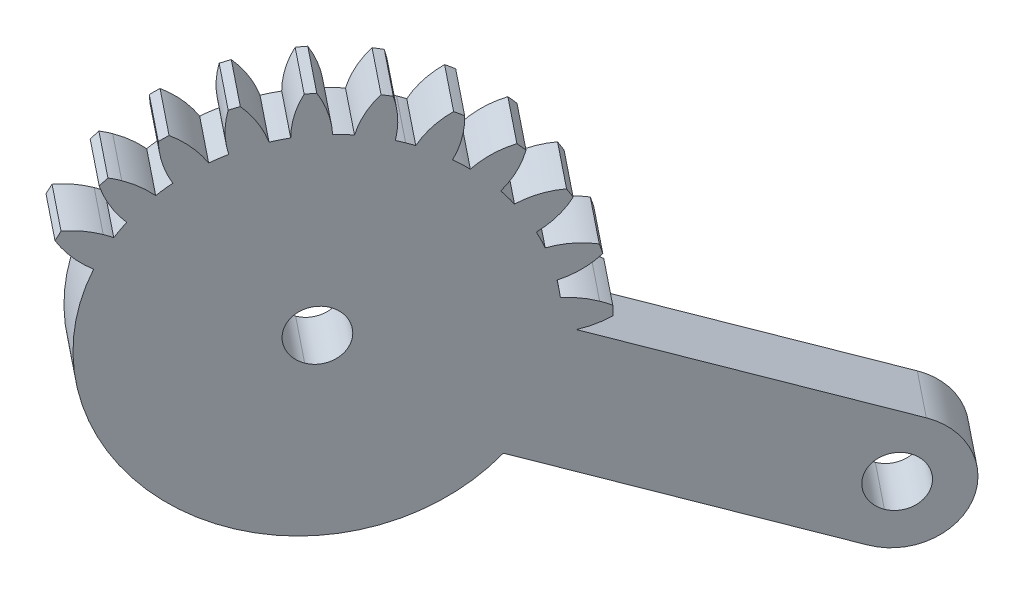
ISO-10303-21;
HEADER;
FILE_DESCRIPTION(('STEP AP214'),'2;1');
FILE_NAME('part.step','',(''),(''),'','','');
FILE_SCHEMA(('AUTOMOTIVE_DESIGN { 1 0 10303 214 1 1 1 1 }'));
ENDSEC;
DATA;
#1=APPLICATION_CONTEXT('core data for automotive mechanical design processes');
#2=APPLICATION_PROTOCOL_DEFINITION('international standard','automotive_design',2000,#1);
#3=PRODUCT_CONTEXT('',#1,'mechanical');
#4=PRODUCT('Part','Part','',(#3));
#5=PRODUCT_RELATED_PRODUCT_CATEGORY('part','',(#4));
#6=PRODUCT_DEFINITION_FORMATION('','',#4);
#7=PRODUCT_DEFINITION_CONTEXT('part definition',#1,'design');
#8=PRODUCT_DEFINITION('design','',#6,#7);
#9=PRODUCT_DEFINITION_SHAPE('','',#8);
#10=(LENGTH_UNIT() NAMED_UNIT(*) SI_UNIT(.MILLI.,.METRE.));
#11=(NAMED_UNIT(*) PLANE_ANGLE_UNIT() SI_UNIT($,.RADIAN.));
#12=(NAMED_UNIT(*) SI_UNIT($,.STERADIAN.) SOLID_ANGLE_UNIT());
#13=UNCERTAINTY_MEASURE_WITH_UNIT(LENGTH_MEASURE(1.E-05),#10,'distance_accuracy_value','');
#14=(GEOMETRIC_REPRESENTATION_CONTEXT(3) GLOBAL_UNCERTAINTY_ASSIGNED_CONTEXT((#13)) GLOBAL_UNIT_ASSIGNED_CONTEXT((#10,
#11,#12)) REPRESENTATION_CONTEXT('',''));
#15=CARTESIAN_POINT('',(0.,0.,0.));
#16=DIRECTION('',(0.,0.,1.));
#17=DIRECTION('',(1.,0.,0.));
#18=AXIS2_PLACEMENT_3D('',#15,#16,#17);
#19=CARTESIAN_POINT('',(208.131531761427,-88.4328998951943,201.031825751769));
#20=DIRECTION('',(-0.781080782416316,0.00440513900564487,-0.624414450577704));
#21=DIRECTION('',(0.228266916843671,0.932778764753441,-0.278958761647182));
#22=AXIS2_PLACEMENT_3D('',#19,#20,#21);
#23=CYLINDRICAL_SURFACE('',#22,1.75);
#24=DIRECTION('',(-0.781080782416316,0.00440513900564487,-0.624414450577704));
#25=VECTOR('',#24,1.);
#26=CARTESIAN_POINT('',(207.732064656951,-90.0652627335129,201.520003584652));
#27=LINE('',#26,#25);
#28=CARTESIAN_POINT('',(207.732064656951,-90.0652627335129,201.520003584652));
#29=VERTEX_POINT('',#28);
#30=CARTESIAN_POINT('',(204.607741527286,-90.0476421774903,199.022345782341));
#31=VERTEX_POINT('',#30);
#32=EDGE_CURVE('E1061',#29,#31,#27,.T.);
#33=ORIENTED_EDGE('',*,*,#32,.F.);
#34=CARTESIAN_POINT('',(208.131531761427,-88.4328998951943,201.031825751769));
#35=DIRECTION('',(0.781080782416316,-0.00440513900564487,0.624414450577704));
#36=DIRECTION('',(-0.228266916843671,-0.932778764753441,0.278958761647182));
#37=AXIS2_PLACEMENT_3D('',#34,#35,#36);
#38=CIRCLE('',#37,1.75);
#39=CARTESIAN_POINT('',(208.530998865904,-86.8005370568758,200.543647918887));
#40=VERTEX_POINT('',#39);
#41=EDGE_CURVE('E686',#29,#40,#38,.T.);
#42=ORIENTED_EDGE('',*,*,#41,.T.);
#43=DIRECTION('',(-0.781080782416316,0.00440513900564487,-0.624414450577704));
#44=VECTOR('',#43,1.);
#45=CARTESIAN_POINT('',(208.530998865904,-86.8005370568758,200.543647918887));
#46=LINE('',#45,#44);
#47=CARTESIAN_POINT('',(205.406675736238,-86.7829165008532,198.045990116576));
#48=VERTEX_POINT('',#47);
#49=EDGE_CURVE('E998',#40,#48,#46,.T.);
#50=ORIENTED_EDGE('',*,*,#49,.T.);
#51=CARTESIAN_POINT('',(205.007208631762,-88.4152793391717,198.534167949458));
#52=DIRECTION('',(0.781080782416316,-0.00440513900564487,0.624414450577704));
#53=DIRECTION('',(-0.228266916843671,-0.932778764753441,0.278958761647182));
#54=AXIS2_PLACEMENT_3D('',#51,#52,#53);
#55=CIRCLE('',#54,1.75);
#56=EDGE_CURVE('E689',#31,#48,#55,.T.);
#57=ORIENTED_EDGE('',*,*,#56,.F.);
#58=EDGE_LOOP('',(#33,#42,#50,#57));
#59=FACE_BOUND('',#58,.T.);
#60=ADVANCED_FACE('F17',(#59),#23,.F.);
#61=CARTESIAN_POINT('',(190.259272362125,-77.3499083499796,223.46644503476));
#62=DIRECTION('',(-0.781080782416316,0.00440513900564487,-0.624414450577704));
#63=DIRECTION('',(0.228266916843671,0.932778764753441,-0.278958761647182));
#64=AXIS2_PLACEMENT_3D('',#61,#62,#63);
#65=CYLINDRICAL_SURFACE('',#64,1.75);
#66=DIRECTION('',(-0.781080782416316,0.00440513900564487,-0.624414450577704));
#67=VECTOR('',#66,1.);
#68=CARTESIAN_POINT('',(189.859805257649,-78.9822711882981,223.954622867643));
#69=LINE('',#68,#67);
#70=CARTESIAN_POINT('',(189.859805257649,-78.9822711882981,223.954622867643));
#71=VERTEX_POINT('',#70);
#72=CARTESIAN_POINT('',(186.735482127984,-78.9646506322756,221.456965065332));
#73=VERTEX_POINT('',#72);
#74=EDGE_CURVE('E997',#71,#73,#69,.T.);
#75=ORIENTED_EDGE('',*,*,#74,.F.);
#76=CARTESIAN_POINT('',(190.259272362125,-77.3499083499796,223.46644503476));
#77=DIRECTION('',(0.781080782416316,-0.00440513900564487,0.624414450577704));
#78=DIRECTION('',(-0.228266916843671,-0.932778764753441,0.278958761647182));
#79=AXIS2_PLACEMENT_3D('',#76,#77,#78);
#80=CIRCLE('',#79,1.75);
#81=CARTESIAN_POINT('',(190.658739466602,-75.7175455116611,222.978267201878));
#82=VERTEX_POINT('',#81);
#83=EDGE_CURVE('E682',#71,#82,#80,.T.);
#84=ORIENTED_EDGE('',*,*,#83,.T.);
#85=DIRECTION('',(-0.781080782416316,0.00440513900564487,-0.624414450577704));
#86=VECTOR('',#85,1.);
#87=CARTESIAN_POINT('',(190.658739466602,-75.7175455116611,222.978267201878));
#88=LINE('',#87,#86);
#89=CARTESIAN_POINT('',(187.534416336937,-75.6999249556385,220.480609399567));
#90=VERTEX_POINT('',#89);
#91=EDGE_CURVE('E1022',#82,#90,#88,.T.);
#92=ORIENTED_EDGE('',*,*,#91,.T.);
#93=CARTESIAN_POINT('',(187.13494923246,-77.332287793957,220.96878723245));
#94=DIRECTION('',(0.781080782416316,-0.00440513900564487,0.624414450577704));
#95=DIRECTION('',(-0.228266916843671,-0.932778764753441,0.278958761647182));
#96=AXIS2_PLACEMENT_3D('',#93,#94,#95);
#97=CIRCLE('',#96,1.75);
#98=EDGE_CURVE('E719',#73,#90,#97,.T.);
#99=ORIENTED_EDGE('',*,*,#98,.F.);
#100=EDGE_LOOP('',(#75,#84,#92,#99));
#101=FACE_BOUND('',#100,.T.);
#102=ADVANCED_FACE('F1199',(#101),#65,.F.);
#103=CARTESIAN_POINT('',(196.430003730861,-85.4738471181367,215.690156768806));
#104=DIRECTION('',(0.228266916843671,0.932778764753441,-0.278958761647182));
#105=DIRECTION('',(-0.781080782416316,0.00440513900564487,-0.624414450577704));
#106=AXIS2_PLACEMENT_3D('',#103,#104,#105);
#107=PLANE('',#106);
#108=DIRECTION('',(0.581211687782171,-0.360422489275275,-0.729581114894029));
#109=VECTOR('',#108,1.);
#110=CARTESIAN_POINT('',(193.305680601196,-85.4562265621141,213.192498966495));
#111=LINE('',#110,#109);
#112=CARTESIAN_POINT('',(192.854691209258,-85.1765578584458,213.758615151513));
#113=VERTEX_POINT('',#112);
#114=CARTESIAN_POINT('',(204.094140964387,-92.1463943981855,199.650002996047));
#115=VERTEX_POINT('',#114);
#116=EDGE_CURVE('E643',#113,#115,#111,.T.);
#117=ORIENTED_EDGE('',*,*,#116,.T.);
#118=DIRECTION('',(-0.781080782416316,0.00440513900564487,-0.624414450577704));
#119=VECTOR('',#118,1.);
#120=CARTESIAN_POINT('',(207.218464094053,-92.1640149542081,202.147660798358));
#121=LINE('',#120,#119);
#122=CARTESIAN_POINT('',(207.218464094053,-92.1640149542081,202.147660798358));
#123=VERTEX_POINT('',#122);
#124=EDGE_CURVE('E440',#123,#115,#121,.T.);
#125=ORIENTED_EDGE('',*,*,#124,.F.);
#126=DIRECTION('',(0.581211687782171,-0.360422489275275,-0.729581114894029));
#127=VECTOR('',#126,1.);
#128=CARTESIAN_POINT('',(196.430003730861,-85.4738471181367,215.690156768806));
#129=LINE('',#128,#127);
#130=CARTESIAN_POINT('',(195.979014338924,-85.1941784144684,216.256272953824));
#131=VERTEX_POINT('',#130);
#132=EDGE_CURVE('E438',#131,#123,#129,.T.);
#133=ORIENTED_EDGE('',*,*,#132,.F.);
#134=DIRECTION('',(0.781080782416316,-0.00440513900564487,0.624414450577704));
#135=VECTOR('',#134,1.);
#136=CARTESIAN_POINT('',(188.16820651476,-85.1501270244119,210.012128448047));
#137=LINE('',#136,#135);
#138=EDGE_CURVE('E10',#113,#131,#137,.T.);
#139=ORIENTED_EDGE('',*,*,#138,.F.);
#140=EDGE_LOOP('',(#117,#125,#133,#139));
#141=FACE_BOUND('',#140,.T.);
#142=ADVANCED_FACE('F439',(#141),#107,.F.);
#143=CARTESIAN_POINT('',(190.259272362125,-77.3499083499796,223.46644503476));
#144=DIRECTION('',(-0.781080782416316,0.00440513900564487,-0.624414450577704));
#145=DIRECTION('',(0.228266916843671,0.932778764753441,-0.278958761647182));
#146=AXIS2_PLACEMENT_3D('',#143,#144,#145);
#147=CYLINDRICAL_SURFACE('',#146,12.09275);
#148=CARTESIAN_POINT('',(187.13494923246,-77.332287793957,220.96878723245));
#149=DIRECTION('',(0.781080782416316,-0.00440513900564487,0.624414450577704));
#150=DIRECTION('',(-0.228266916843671,-0.932778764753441,0.278958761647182));
#151=AXIS2_PLACEMENT_3D('',#148,#149,#150);
#152=CIRCLE('',#151,12.09275);
#153=CARTESIAN_POINT('',(180.237469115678,-72.4719405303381,229.631142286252));
#154=VERTEX_POINT('',#153);
#155=EDGE_CURVE('E433',#154,#113,#152,.T.);
#156=ORIENTED_EDGE('',*,*,#155,.T.);
#157=ORIENTED_EDGE('',*,*,#138,.T.);
#158=CARTESIAN_POINT('',(190.259272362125,-77.3499083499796,223.46644503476));
#159=DIRECTION('',(0.781080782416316,-0.00440513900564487,0.624414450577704));
#160=DIRECTION('',(-0.228266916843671,-0.932778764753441,0.278958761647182));
#161=AXIS2_PLACEMENT_3D('',#158,#159,#160);
#162=CIRCLE('',#161,12.09275);
#163=CARTESIAN_POINT('',(183.361792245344,-72.4895610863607,232.128800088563));
#164=VERTEX_POINT('',#163);
#165=EDGE_CURVE('E431',#164,#131,#162,.T.);
#166=ORIENTED_EDGE('',*,*,#165,.F.);
#167=DIRECTION('',(-0.781080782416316,0.00440513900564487,-0.624414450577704));
#168=VECTOR('',#167,1.);
#169=CARTESIAN_POINT('',(183.361792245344,-72.4895610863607,232.128800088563));
#170=LINE('',#169,#168);
#171=EDGE_CURVE('E26',#164,#154,#170,.T.);
#172=ORIENTED_EDGE('',*,*,#171,.T.);
#173=EDGE_LOOP('',(#156,#157,#166,#172));
#174=FACE_BOUND('',#173,.T.);
#175=ADVANCED_FACE('F429',(#174),#147,.T.);
#176=CARTESIAN_POINT('',(185.066716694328,-67.8157604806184,230.029080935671));
#177=DIRECTION('',(-0.781080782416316,0.00440513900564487,-0.624414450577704));
#178=DIRECTION('',(0.228266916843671,0.932778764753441,-0.278958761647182));
#179=AXIS2_PLACEMENT_3D('',#176,#177,#178);
#180=CYLINDRICAL_SURFACE('',#179,5.4);
#181=CARTESIAN_POINT('',(181.942393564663,-67.7981399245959,227.53142313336));
#182=DIRECTION('',(0.781080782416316,-0.00440513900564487,0.624414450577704));
#183=DIRECTION('',(-0.228266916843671,-0.932778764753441,0.278958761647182));
#184=AXIS2_PLACEMENT_3D('',#181,#182,#183);
#185=CIRCLE('',#184,5.4);
#186=CARTESIAN_POINT('',(179.050712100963,-70.601111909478,231.128856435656));
#187=VERTEX_POINT('',#186);
#188=EDGE_CURVE('E642',#187,#154,#185,.T.);
#189=ORIENTED_EDGE('',*,*,#188,.T.);
#190=ORIENTED_EDGE('',*,*,#171,.F.);
#191=CARTESIAN_POINT('',(185.066716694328,-67.8157604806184,230.029080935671));
#192=DIRECTION('',(0.781080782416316,-0.00440513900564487,0.624414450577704));
#193=DIRECTION('',(-0.228266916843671,-0.932778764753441,0.278958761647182));
#194=AXIS2_PLACEMENT_3D('',#191,#192,#193);
#195=CIRCLE('',#194,5.4);
#196=CARTESIAN_POINT('',(182.175035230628,-70.6187324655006,233.626514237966));
#197=VERTEX_POINT('',#196);
#198=EDGE_CURVE('E449',#197,#164,#195,.T.);
#199=ORIENTED_EDGE('',*,*,#198,.F.);
#200=DIRECTION('',(-0.781080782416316,0.00440513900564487,-0.624414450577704));
#201=VECTOR('',#200,1.);
#202=CARTESIAN_POINT('',(182.175035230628,-70.6187324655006,233.626514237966));
#203=LINE('',#202,#201);
#204=EDGE_CURVE('E891',#197,#187,#203,.T.);
#205=ORIENTED_EDGE('',*,*,#204,.T.);
#206=EDGE_LOOP('',(#189,#190,#199,#205));
#207=FACE_BOUND('',#206,.T.);
#208=ADVANCED_FACE('F897',(#207),#180,.T.);
#209=CARTESIAN_POINT('',(190.259272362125,-77.3499083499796,223.46644503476));
#210=DIRECTION('',(-0.781080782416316,0.00440513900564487,-0.624414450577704));
#211=DIRECTION('',(0.228266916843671,0.932778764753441,-0.278958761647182));
#212=AXIS2_PLACEMENT_3D('',#209,#210,#211);
#213=CYLINDRICAL_SURFACE('',#212,14.625);
#214=CARTESIAN_POINT('',(187.13494923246,-77.332287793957,220.96878723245));
#215=DIRECTION('',(0.781080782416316,-0.00440513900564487,0.624414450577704));
#216=DIRECTION('',(-0.228266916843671,-0.932778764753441,0.278958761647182));
#217=AXIS2_PLACEMENT_3D('',#214,#215,#216);
#218=CIRCLE('',#217,14.625);
#219=CARTESIAN_POINT('',(179.239323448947,-70.053240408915,230.896787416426));
#220=VERTEX_POINT('',#219);
#221=EDGE_CURVE('E561',#220,#187,#218,.T.);
#222=ORIENTED_EDGE('',*,*,#221,.T.);
#223=ORIENTED_EDGE('',*,*,#204,.F.);
#224=CARTESIAN_POINT('',(190.259272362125,-77.3499083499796,223.46644503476));
#225=DIRECTION('',(0.781080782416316,-0.00440513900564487,0.624414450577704));
#226=DIRECTION('',(-0.228266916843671,-0.932778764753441,0.278958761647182));
#227=AXIS2_PLACEMENT_3D('',#224,#225,#226);
#228=CIRCLE('',#227,14.625);
#229=CARTESIAN_POINT('',(182.363646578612,-70.0708609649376,233.394445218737));
#230=VERTEX_POINT('',#229);
#231=EDGE_CURVE('E678',#230,#197,#228,.T.);
#232=ORIENTED_EDGE('',*,*,#231,.F.);
#233=DIRECTION('',(-0.781080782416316,0.00440513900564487,-0.624414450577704));
#234=VECTOR('',#233,1.);
#235=CARTESIAN_POINT('',(182.363646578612,-70.0708609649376,233.394445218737));
#236=LINE('',#235,#234);
#237=EDGE_CURVE('E1041',#230,#220,#236,.T.);
#238=ORIENTED_EDGE('',*,*,#237,.T.);
#239=EDGE_LOOP('',(#222,#223,#232,#238));
#240=FACE_BOUND('',#239,.T.);
#241=ADVANCED_FACE('F1263',(#240),#213,.T.);
#242=CARTESIAN_POINT('',(182.431992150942,-75.4690141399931,233.270868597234));
#243=DIRECTION('',(-0.781080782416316,0.00440513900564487,-0.624414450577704));
#244=DIRECTION('',(0.228266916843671,0.932778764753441,-0.278958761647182));
#245=AXIS2_PLACEMENT_3D('',#242,#243,#244);
#246=CYLINDRICAL_SURFACE('',#245,5.4);
#247=DIRECTION('',(-0.781080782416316,0.00440513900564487,-0.624414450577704));
#248=VECTOR('',#247,1.);
#249=CARTESIAN_POINT('',(183.664633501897,-70.4320088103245,231.764491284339));
#250=LINE('',#249,#248);
#251=CARTESIAN_POINT('',(183.664633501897,-70.4320088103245,231.764491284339));
#252=VERTEX_POINT('',#251);
#253=CARTESIAN_POINT('',(180.540310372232,-70.4143882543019,229.266833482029));
#254=VERTEX_POINT('',#253);
#255=EDGE_CURVE('E1030',#252,#254,#250,.T.);
#256=ORIENTED_EDGE('',*,*,#255,.F.);
#257=CARTESIAN_POINT('',(182.431992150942,-75.4690141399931,233.270868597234));
#258=DIRECTION('',(0.781080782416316,-0.00440513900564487,0.624414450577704));
#259=DIRECTION('',(-0.228266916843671,-0.932778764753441,0.278958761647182));
#260=AXIS2_PLACEMENT_3D('',#257,#258,#259);
#261=CIRCLE('',#260,5.4);
#262=CARTESIAN_POINT('',(183.989566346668,-70.666025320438,231.356381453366));
#263=VERTEX_POINT('',#262);
#264=EDGE_CURVE('E674',#263,#252,#261,.T.);
#265=ORIENTED_EDGE('',*,*,#264,.F.);
#266=DIRECTION('',(-0.781080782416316,0.00440513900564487,-0.624414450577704));
#267=VECTOR('',#266,1.);
#268=CARTESIAN_POINT('',(183.989566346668,-70.666025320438,231.356381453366));
#269=LINE('',#268,#267);
#270=CARTESIAN_POINT('',(180.865243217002,-70.6484047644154,228.858723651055));
#271=VERTEX_POINT('',#270);
#272=EDGE_CURVE('E888',#263,#271,#269,.T.);
#273=ORIENTED_EDGE('',*,*,#272,.T.);
#274=CARTESIAN_POINT('',(179.307669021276,-75.4513935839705,230.773210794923));
#275=DIRECTION('',(0.781080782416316,-0.00440513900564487,0.624414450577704));
#276=DIRECTION('',(-0.228266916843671,-0.932778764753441,0.278958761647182));
#277=AXIS2_PLACEMENT_3D('',#274,#275,#276);
#278=CIRCLE('',#277,5.4);
#279=EDGE_CURVE('E557',#271,#254,#278,.T.);
#280=ORIENTED_EDGE('',*,*,#279,.T.);
#281=EDGE_LOOP('',(#256,#265,#273,#280));
#282=FACE_BOUND('',#281,.T.);
#283=ADVANCED_FACE('F1113',(#282),#246,.T.);
#284=CARTESIAN_POINT('',(190.259272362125,-77.3499083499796,223.46644503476));
#285=DIRECTION('',(-0.781080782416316,0.00440513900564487,-0.624414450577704));
#286=DIRECTION('',(0.228266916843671,0.932778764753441,-0.278958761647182));
#287=AXIS2_PLACEMENT_3D('',#284,#285,#286);
#288=CYLINDRICAL_SURFACE('',#287,12.09275);
#289=CARTESIAN_POINT('',(187.13494923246,-77.332287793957,220.96878723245));
#290=DIRECTION('',(0.781080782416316,-0.00440513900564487,0.624414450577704));
#291=DIRECTION('',(-0.228266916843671,-0.932778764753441,0.278958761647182));
#292=AXIS2_PLACEMENT_3D('',#289,#290,#291);
#293=CIRCLE('',#292,12.09275);
#294=CARTESIAN_POINT('',(181.267853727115,-69.7716792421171,228.361282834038));
#295=VERTEX_POINT('',#294);
#296=EDGE_CURVE('E560',#295,#271,#293,.T.);
#297=ORIENTED_EDGE('',*,*,#296,.T.);
#298=ORIENTED_EDGE('',*,*,#272,.F.);
#299=CARTESIAN_POINT('',(190.259272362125,-77.3499083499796,223.46644503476));
#300=DIRECTION('',(0.781080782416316,-0.00440513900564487,0.624414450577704));
#301=DIRECTION('',(-0.228266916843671,-0.932778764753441,0.278958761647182));
#302=AXIS2_PLACEMENT_3D('',#299,#300,#301);
#303=CIRCLE('',#302,12.09275);
#304=CARTESIAN_POINT('',(184.392176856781,-69.7892997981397,230.858940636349));
#305=VERTEX_POINT('',#304);
#306=EDGE_CURVE('E679',#305,#263,#303,.T.);
#307=ORIENTED_EDGE('',*,*,#306,.F.);
#308=DIRECTION('',(-0.781080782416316,0.00440513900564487,-0.624414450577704));
#309=VECTOR('',#308,1.);
#310=CARTESIAN_POINT('',(184.392176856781,-69.7892997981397,230.858940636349));
#311=LINE('',#310,#309);
#312=EDGE_CURVE('E884',#305,#295,#311,.T.);
#313=ORIENTED_EDGE('',*,*,#312,.T.);
#314=EDGE_LOOP('',(#297,#298,#307,#313));
#315=FACE_BOUND('',#314,.T.);
#316=ADVANCED_FACE('F1109',(#315),#288,.T.);
#317=CARTESIAN_POINT('',(186.791948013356,-65.974764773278,227.883974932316));
#318=DIRECTION('',(-0.781080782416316,0.00440513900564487,-0.624414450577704));
#319=DIRECTION('',(0.228266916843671,0.932778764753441,-0.278958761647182));
#320=AXIS2_PLACEMENT_3D('',#317,#318,#319);
#321=CYLINDRICAL_SURFACE('',#320,5.4);
#322=CARTESIAN_POINT('',(183.667624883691,-65.9571442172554,225.386317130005));
#323=DIRECTION('',(0.781080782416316,-0.00440513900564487,0.624414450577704));
#324=DIRECTION('',(-0.228266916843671,-0.932778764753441,0.278958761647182));
#325=AXIS2_PLACEMENT_3D('',#322,#323,#324);
#326=CIRCLE('',#325,5.4);
#327=CARTESIAN_POINT('',(180.425587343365,-67.4700295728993,229.431112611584));
#328=VERTEX_POINT('',#327);
#329=EDGE_CURVE('E700',#328,#295,#326,.T.);
#330=ORIENTED_EDGE('',*,*,#329,.T.);
#331=ORIENTED_EDGE('',*,*,#312,.F.);
#332=CARTESIAN_POINT('',(186.791948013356,-65.974764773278,227.883974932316));
#333=DIRECTION('',(0.781080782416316,-0.00440513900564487,0.624414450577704));
#334=DIRECTION('',(-0.228266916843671,-0.932778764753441,0.278958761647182));
#335=AXIS2_PLACEMENT_3D('',#332,#333,#334);
#336=CIRCLE('',#335,5.4);
#337=CARTESIAN_POINT('',(183.549910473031,-67.4876501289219,231.928770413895));
#338=VERTEX_POINT('',#337);
#339=EDGE_CURVE('E673',#338,#305,#336,.T.);
#340=ORIENTED_EDGE('',*,*,#339,.F.);
#341=DIRECTION('',(-0.781080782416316,0.00440513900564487,-0.624414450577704));
#342=VECTOR('',#341,1.);
#343=CARTESIAN_POINT('',(183.549910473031,-67.4876501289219,231.928770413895));
#344=LINE('',#343,#342);
#345=EDGE_CURVE('E881',#338,#328,#344,.T.);
#346=ORIENTED_EDGE('',*,*,#345,.T.);
#347=EDGE_LOOP('',(#330,#331,#340,#346));
#348=FACE_BOUND('',#347,.T.);
#349=ADVANCED_FACE('F1255',(#348),#321,.T.);
#350=CARTESIAN_POINT('',(190.259272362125,-77.3499083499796,223.46644503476));
#351=DIRECTION('',(-0.781080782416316,0.00440513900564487,-0.624414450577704));
#352=DIRECTION('',(0.228266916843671,0.932778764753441,-0.278958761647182));
#353=AXIS2_PLACEMENT_3D('',#350,#351,#352);
#354=CYLINDRICAL_SURFACE('',#353,14.625);
#355=CARTESIAN_POINT('',(187.13494923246,-77.332287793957,220.96878723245));
#356=DIRECTION('',(0.781080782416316,-0.00440513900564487,0.624414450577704));
#357=DIRECTION('',(-0.228266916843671,-0.932778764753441,0.278958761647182));
#358=AXIS2_PLACEMENT_3D('',#355,#356,#357);
#359=CIRCLE('',#358,14.625);
#360=CARTESIAN_POINT('',(180.696049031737,-67.0182226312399,229.095979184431));
#361=VERTEX_POINT('',#360);
#362=EDGE_CURVE('E704',#361,#328,#359,.T.);
#363=ORIENTED_EDGE('',*,*,#362,.T.);
#364=ORIENTED_EDGE('',*,*,#345,.F.);
#365=CARTESIAN_POINT('',(190.259272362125,-77.3499083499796,223.46644503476));
#366=DIRECTION('',(0.781080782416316,-0.00440513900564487,0.624414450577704));
#367=DIRECTION('',(-0.228266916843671,-0.932778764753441,0.278958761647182));
#368=AXIS2_PLACEMENT_3D('',#365,#366,#367);
#369=CIRCLE('',#368,14.625);
#370=CARTESIAN_POINT('',(183.820372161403,-67.0358431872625,231.593636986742));
#371=VERTEX_POINT('',#370);
#372=EDGE_CURVE('E524',#371,#338,#369,.T.);
#373=ORIENTED_EDGE('',*,*,#372,.F.);
#374=DIRECTION('',(-0.781080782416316,0.00440513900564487,-0.624414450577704));
#375=VECTOR('',#374,1.);
#376=CARTESIAN_POINT('',(183.820372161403,-67.0358431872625,231.593636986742));
#377=LINE('',#376,#375);
#378=EDGE_CURVE('E944',#371,#361,#377,.T.);
#379=ORIENTED_EDGE('',*,*,#378,.T.);
#380=EDGE_LOOP('',(#363,#364,#373,#379));
#381=FACE_BOUND('',#380,.T.);
#382=ADVANCED_FACE('F1260',(#381),#354,.T.);
#383=CARTESIAN_POINT('',(183.013850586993,-72.2860861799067,232.565476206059));
#384=DIRECTION('',(-0.781080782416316,0.00440513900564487,-0.624414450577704));
#385=DIRECTION('',(0.228266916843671,0.932778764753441,-0.278958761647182));
#386=AXIS2_PLACEMENT_3D('',#383,#384,#385);
#387=CYLINDRICAL_SURFACE('',#386,5.4);
#388=DIRECTION('',(-0.781080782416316,0.00440513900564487,-0.624414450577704));
#389=VECTOR('',#388,1.);
#390=CARTESIAN_POINT('',(184.246491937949,-67.2490808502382,231.059098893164));
#391=LINE('',#390,#389);
#392=CARTESIAN_POINT('',(184.246491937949,-67.2490808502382,231.059098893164));
#393=VERTEX_POINT('',#392);
#394=CARTESIAN_POINT('',(181.122168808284,-67.2314602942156,228.561441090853));
#395=VERTEX_POINT('',#394);
#396=EDGE_CURVE('E942',#393,#395,#391,.T.);
#397=ORIENTED_EDGE('',*,*,#396,.F.);
#398=CARTESIAN_POINT('',(183.013850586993,-72.2860861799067,232.565476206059));
#399=DIRECTION('',(0.781080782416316,-0.00440513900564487,0.624414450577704));
#400=DIRECTION('',(-0.228266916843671,-0.932778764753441,0.278958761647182));
#401=AXIS2_PLACEMENT_3D('',#398,#399,#400);
#402=CIRCLE('',#401,5.4);
#403=CARTESIAN_POINT('',(185.292381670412,-68.2855053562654,229.743482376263));
#404=VERTEX_POINT('',#403);
#405=EDGE_CURVE('E521',#404,#393,#402,.T.);
#406=ORIENTED_EDGE('',*,*,#405,.F.);
#407=DIRECTION('',(-0.781080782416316,0.00440513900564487,-0.624414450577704));
#408=VECTOR('',#407,1.);
#409=CARTESIAN_POINT('',(185.292381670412,-68.2855053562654,229.743482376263));
#410=LINE('',#409,#408);
#411=CARTESIAN_POINT('',(182.168058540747,-68.2678848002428,227.245824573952));
#412=VERTEX_POINT('',#411);
#413=EDGE_CURVE('E878',#404,#412,#410,.T.);
#414=ORIENTED_EDGE('',*,*,#413,.T.);
#415=CARTESIAN_POINT('',(179.889527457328,-72.2684656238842,230.067818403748));
#416=DIRECTION('',(0.781080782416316,-0.00440513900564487,0.624414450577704));
#417=DIRECTION('',(-0.228266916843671,-0.932778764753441,0.278958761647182));
#418=AXIS2_PLACEMENT_3D('',#415,#416,#417);
#419=CIRCLE('',#418,5.4);
#420=EDGE_CURVE('E708',#412,#395,#419,.T.);
#421=ORIENTED_EDGE('',*,*,#420,.T.);
#422=EDGE_LOOP('',(#397,#406,#414,#421));
#423=FACE_BOUND('',#422,.T.);
#424=ADVANCED_FACE('F1137',(#423),#387,.T.);
#425=CARTESIAN_POINT('',(190.259272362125,-77.3499083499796,223.46644503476));
#426=DIRECTION('',(-0.781080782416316,0.00440513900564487,-0.624414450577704));
#427=DIRECTION('',(0.228266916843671,0.932778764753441,-0.278958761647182));
#428=AXIS2_PLACEMENT_3D('',#425,#426,#427);
#429=CYLINDRICAL_SURFACE('',#428,12.09275);
#430=CARTESIAN_POINT('',(187.13494923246,-77.332287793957,220.96878723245));
#431=DIRECTION('',(0.781080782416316,-0.00440513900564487,0.624414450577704));
#432=DIRECTION('',(-0.228266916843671,-0.932778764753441,0.278958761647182));
#433=AXIS2_PLACEMENT_3D('',#430,#431,#432);
#434=CIRCLE('',#433,12.09275);
#435=CARTESIAN_POINT('',(182.698071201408,-67.5866609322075,226.587637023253));
#436=VERTEX_POINT('',#435);
#437=EDGE_CURVE('E718',#436,#412,#434,.T.);
#438=ORIENTED_EDGE('',*,*,#437,.T.);
#439=ORIENTED_EDGE('',*,*,#413,.F.);
#440=CARTESIAN_POINT('',(190.259272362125,-77.3499083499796,223.46644503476));
#441=DIRECTION('',(0.781080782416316,-0.00440513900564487,0.624414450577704));
#442=DIRECTION('',(-0.228266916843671,-0.932778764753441,0.278958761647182));
#443=AXIS2_PLACEMENT_3D('',#440,#441,#442);
#444=CIRCLE('',#443,12.09275);
#445=CARTESIAN_POINT('',(185.822394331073,-67.6042814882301,229.085294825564));
#446=VERTEX_POINT('',#445);
#447=EDGE_CURVE('E525',#446,#404,#444,.T.);
#448=ORIENTED_EDGE('',*,*,#447,.F.);
#449=DIRECTION('',(-0.781080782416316,0.00440513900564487,-0.624414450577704));
#450=VECTOR('',#449,1.);
#451=CARTESIAN_POINT('',(185.822394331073,-67.6042814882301,229.085294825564));
#452=LINE('',#451,#450);
#453=EDGE_CURVE('E875',#446,#436,#452,.T.);
#454=ORIENTED_EDGE('',*,*,#453,.T.);
#455=EDGE_LOOP('',(#438,#439,#448,#454));
#456=FACE_BOUND('',#455,.T.);
#457=ADVANCED_FACE('F1130',(#456),#429,.T.);
#458=CARTESIAN_POINT('',(188.753471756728,-64.9089663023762,225.437821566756));
#459=DIRECTION('',(-0.781080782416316,0.00440513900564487,-0.624414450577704));
#460=DIRECTION('',(0.228266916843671,0.932778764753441,-0.278958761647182));
#461=AXIS2_PLACEMENT_3D('',#458,#459,#460);
#462=CYLINDRICAL_SURFACE('',#461,5.4);
#463=CARTESIAN_POINT('',(185.629148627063,-64.8913457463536,222.940163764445));
#464=DIRECTION('',(0.781080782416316,-0.00440513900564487,0.624414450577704));
#465=DIRECTION('',(-0.228266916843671,-0.932778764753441,0.278958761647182));
#466=AXIS2_PLACEMENT_3D('',#463,#464,#465);
#467=CIRCLE('',#466,5.4);
#468=CARTESIAN_POINT('',(182.257694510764,-65.0110438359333,227.156675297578));
#469=VERTEX_POINT('',#468);
#470=EDGE_CURVE('E727',#469,#436,#467,.T.);
#471=ORIENTED_EDGE('',*,*,#470,.T.);
#472=ORIENTED_EDGE('',*,*,#453,.F.);
#473=CARTESIAN_POINT('',(188.753471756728,-64.9089663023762,225.437821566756));
#474=DIRECTION('',(0.781080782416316,-0.00440513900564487,0.624414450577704));
#475=DIRECTION('',(-0.228266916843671,-0.932778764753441,0.278958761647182));
#476=AXIS2_PLACEMENT_3D('',#473,#474,#475);
#477=CIRCLE('',#476,5.4);
#478=CARTESIAN_POINT('',(185.38201764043,-65.0286643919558,229.654333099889));
#479=VERTEX_POINT('',#478);
#480=EDGE_CURVE('E655',#479,#446,#477,.T.);
#481=ORIENTED_EDGE('',*,*,#480,.F.);
#482=DIRECTION('',(-0.781080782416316,0.00440513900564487,-0.624414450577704));
#483=VECTOR('',#482,1.);
#484=CARTESIAN_POINT('',(185.38201764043,-65.0286643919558,229.654333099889));
#485=LINE('',#484,#483);
#486=EDGE_CURVE('E668',#479,#469,#485,.T.);
#487=ORIENTED_EDGE('',*,*,#486,.T.);
#488=EDGE_LOOP('',(#471,#472,#481,#487));
#489=FACE_BOUND('',#488,.T.);
#490=ADVANCED_FACE('F1321',(#489),#462,.T.);
#491=CARTESIAN_POINT('',(190.259272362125,-77.3499083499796,223.46644503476));
#492=DIRECTION('',(-0.781080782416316,0.00440513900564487,-0.624414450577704));
#493=DIRECTION('',(0.228266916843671,0.932778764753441,-0.278958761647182));
#494=AXIS2_PLACEMENT_3D('',#491,#492,#493);
#495=CYLINDRICAL_SURFACE('',#494,14.625);
#496=CARTESIAN_POINT('',(187.13494923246,-77.332287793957,220.96878723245));
#497=DIRECTION('',(0.781080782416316,-0.00440513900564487,0.624414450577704));
#498=DIRECTION('',(-0.228266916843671,-0.932778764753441,0.278958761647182));
#499=AXIS2_PLACEMENT_3D('',#496,#497,#498);
#500=CIRCLE('',#499,14.625);
#501=CARTESIAN_POINT('',(182.591575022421,-64.6860913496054,226.741316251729));
#502=VERTEX_POINT('',#501);
#503=EDGE_CURVE('E723',#502,#469,#500,.T.);
#504=ORIENTED_EDGE('',*,*,#503,.T.);
#505=ORIENTED_EDGE('',*,*,#486,.F.);
#506=CARTESIAN_POINT('',(190.259272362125,-77.3499083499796,223.46644503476));
#507=DIRECTION('',(0.781080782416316,-0.00440513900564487,0.624414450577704));
#508=DIRECTION('',(-0.228266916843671,-0.932778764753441,0.278958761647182));
#509=AXIS2_PLACEMENT_3D('',#506,#507,#508);
#510=CIRCLE('',#509,14.625);
#511=CARTESIAN_POINT('',(185.715898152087,-64.703711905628,229.23897405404));
#512=VERTEX_POINT('',#511);
#513=EDGE_CURVE('E651',#512,#479,#510,.T.);
#514=ORIENTED_EDGE('',*,*,#513,.F.);
#515=DIRECTION('',(-0.781080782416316,0.00440513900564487,-0.624414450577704));
#516=VECTOR('',#515,1.);
#517=CARTESIAN_POINT('',(185.715898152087,-64.703711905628,229.23897405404));
#518=LINE('',#517,#516);
#519=EDGE_CURVE('E665',#512,#502,#518,.T.);
#520=ORIENTED_EDGE('',*,*,#519,.T.);
#521=EDGE_LOOP('',(#504,#505,#514,#520));
#522=FACE_BOUND('',#521,.T.);
#523=ADVANCED_FACE('F1318',(#522),#495,.T.);
#524=CARTESIAN_POINT('',(184.089472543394,-69.4482493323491,231.239999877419));
#525=DIRECTION('',(-0.781080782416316,0.00440513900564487,-0.624414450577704));
#526=DIRECTION('',(0.228266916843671,0.932778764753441,-0.278958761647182));
#527=AXIS2_PLACEMENT_3D('',#524,#525,#526);
#528=CYLINDRICAL_SURFACE('',#527,5.4);
#529=CARTESIAN_POINT('',(180.965149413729,-69.4306287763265,228.742342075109));
#530=DIRECTION('',(0.781080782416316,-0.00440513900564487,0.624414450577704));
#531=DIRECTION('',(-0.228266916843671,-0.932778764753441,0.278958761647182));
#532=AXIS2_PLACEMENT_3D('',#529,#530,#531);
#533=CIRCLE('',#532,5.4);
#534=CARTESIAN_POINT('',(183.809359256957,-66.5050889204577,225.205155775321));
#535=VERTEX_POINT('',#534);
#536=EDGE_CURVE('E714',#535,#502,#533,.T.);
#537=ORIENTED_EDGE('',*,*,#536,.T.);
#538=ORIENTED_EDGE('',*,*,#519,.F.);
#539=CARTESIAN_POINT('',(184.089472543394,-69.4482493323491,231.239999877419));
#540=DIRECTION('',(0.781080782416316,-0.00440513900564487,0.624414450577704));
#541=DIRECTION('',(-0.228266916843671,-0.932778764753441,0.278958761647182));
#542=AXIS2_PLACEMENT_3D('',#539,#540,#541);
#543=CIRCLE('',#542,5.4);
#544=CARTESIAN_POINT('',(186.933682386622,-66.5227094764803,227.702813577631));
#545=VERTEX_POINT('',#544);
#546=EDGE_CURVE('E647',#545,#512,#543,.T.);
#547=ORIENTED_EDGE('',*,*,#546,.F.);
#548=DIRECTION('',(-0.781080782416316,0.00440513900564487,-0.624414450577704));
#549=VECTOR('',#548,1.);
#550=CARTESIAN_POINT('',(186.933682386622,-66.5227094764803,227.702813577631));
#551=LINE('',#550,#549);
#552=EDGE_CURVE('E669',#545,#535,#551,.T.);
#553=ORIENTED_EDGE('',*,*,#552,.T.);
#554=EDGE_LOOP('',(#537,#538,#547,#553));
#555=FACE_BOUND('',#554,.T.);
#556=ADVANCED_FACE('F1314',(#555),#528,.T.);
#557=CARTESIAN_POINT('',(190.259272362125,-77.3499083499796,223.46644503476));
#558=DIRECTION('',(-0.781080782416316,0.00440513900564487,-0.624414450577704));
#559=DIRECTION('',(0.228266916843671,0.932778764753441,-0.278958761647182));
#560=AXIS2_PLACEMENT_3D('',#557,#558,#559);
#561=CYLINDRICAL_SURFACE('',#560,12.09275);
#562=CARTESIAN_POINT('',(187.13494923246,-77.332287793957,220.96878723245));
#563=DIRECTION('',(0.781080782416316,-0.00440513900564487,0.624414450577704));
#564=DIRECTION('',(-0.228266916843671,-0.932778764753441,0.278958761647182));
#565=AXIS2_PLACEMENT_3D('',#562,#563,#564);
#566=CIRCLE('',#565,12.09275);
#567=CARTESIAN_POINT('',(184.430654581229,-66.0657909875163,224.431075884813));
#568=VERTEX_POINT('',#567);
#569=EDGE_CURVE('E709',#568,#535,#566,.T.);
#570=ORIENTED_EDGE('',*,*,#569,.T.);
#571=ORIENTED_EDGE('',*,*,#552,.F.);
#572=CARTESIAN_POINT('',(190.259272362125,-77.3499083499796,223.46644503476));
#573=DIRECTION('',(0.781080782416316,-0.00440513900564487,0.624414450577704));
#574=DIRECTION('',(-0.228266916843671,-0.932778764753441,0.278958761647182));
#575=AXIS2_PLACEMENT_3D('',#572,#573,#574);
#576=CIRCLE('',#575,12.09275);
#577=CARTESIAN_POINT('',(187.554977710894,-66.0834115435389,226.928733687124));
#578=VERTEX_POINT('',#577);
#579=EDGE_CURVE('E639',#578,#545,#576,.T.);
#580=ORIENTED_EDGE('',*,*,#579,.F.);
#581=DIRECTION('',(-0.781080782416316,0.00440513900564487,-0.624414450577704));
#582=VECTOR('',#581,1.);
#583=CARTESIAN_POINT('',(187.554977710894,-66.0834115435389,226.928733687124));
#584=LINE('',#583,#582);
#585=EDGE_CURVE('E868',#578,#568,#584,.T.);
#586=ORIENTED_EDGE('',*,*,#585,.T.);
#587=EDGE_LOOP('',(#570,#571,#580,#586));
#588=FACE_BOUND('',#587,.T.);
#589=ADVANCED_FACE('F1311',(#588),#561,.T.);
#590=CARTESIAN_POINT('',(190.817613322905,-64.6909974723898,222.857322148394));
#591=DIRECTION('',(-0.781080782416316,0.00440513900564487,-0.624414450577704));
#592=DIRECTION('',(0.228266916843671,0.932778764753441,-0.278958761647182));
#593=AXIS2_PLACEMENT_3D('',#590,#591,#592);
#594=CYLINDRICAL_SURFACE('',#593,5.4);
#595=CARTESIAN_POINT('',(187.69329019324,-64.6733769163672,220.359664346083));
#596=DIRECTION('',(0.781080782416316,-0.00440513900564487,0.624414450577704));
#597=DIRECTION('',(-0.228266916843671,-0.932778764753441,0.278958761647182));
#598=AXIS2_PLACEMENT_3D('',#595,#596,#597);
#599=CIRCLE('',#598,5.4);
#600=CARTESIAN_POINT('',(184.422178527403,-63.3917305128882,224.460543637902));
#601=VERTEX_POINT('',#600);
#602=EDGE_CURVE('E713',#601,#568,#599,.T.);
#603=ORIENTED_EDGE('',*,*,#602,.T.);
#604=ORIENTED_EDGE('',*,*,#585,.F.);
#605=CARTESIAN_POINT('',(190.817613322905,-64.6909974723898,222.857322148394));
#606=DIRECTION('',(0.781080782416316,-0.00440513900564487,0.624414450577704));
#607=DIRECTION('',(-0.228266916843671,-0.932778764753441,0.278958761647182));
#608=AXIS2_PLACEMENT_3D('',#605,#606,#607);
#609=CIRCLE('',#608,5.4);
#610=CARTESIAN_POINT('',(187.546501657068,-63.4093510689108,226.958201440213));
#611=VERTEX_POINT('',#610);
#612=EDGE_CURVE('E635',#611,#578,#609,.T.);
#613=ORIENTED_EDGE('',*,*,#612,.F.);
#614=DIRECTION('',(-0.781080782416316,0.00440513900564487,-0.624414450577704));
#615=VECTOR('',#614,1.);
#616=CARTESIAN_POINT('',(187.546501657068,-63.4093510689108,226.958201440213));
#617=LINE('',#616,#615);
#618=EDGE_CURVE('E865',#611,#601,#617,.T.);
#619=ORIENTED_EDGE('',*,*,#618,.T.);
#620=EDGE_LOOP('',(#603,#604,#613,#619));
#621=FACE_BOUND('',#620,.T.);
#622=ADVANCED_FACE('F1241',(#621),#594,.T.);
#623=CARTESIAN_POINT('',(190.259272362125,-77.3499083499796,223.46644503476));
#624=DIRECTION('',(-0.781080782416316,0.00440513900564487,-0.624414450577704));
#625=DIRECTION('',(0.228266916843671,0.932778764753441,-0.278958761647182));
#626=AXIS2_PLACEMENT_3D('',#623,#624,#625);
#627=CYLINDRICAL_SURFACE('',#626,14.625);
#628=CARTESIAN_POINT('',(187.13494923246,-77.332287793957,220.96878723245));
#629=DIRECTION('',(0.781080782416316,-0.00440513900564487,0.624414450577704));
#630=DIRECTION('',(-0.228266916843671,-0.932778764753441,0.278958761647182));
#631=AXIS2_PLACEMENT_3D('',#628,#629,#630);
#632=CIRCLE('',#631,14.625);
#633=CARTESIAN_POINT('',(184.796724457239,-63.2157774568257,223.993265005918));
#634=VERTEX_POINT('',#633);
#635=EDGE_CURVE('E734',#634,#601,#632,.T.);
#636=ORIENTED_EDGE('',*,*,#635,.T.);
#637=ORIENTED_EDGE('',*,*,#618,.F.);
#638=CARTESIAN_POINT('',(190.259272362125,-77.3499083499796,223.46644503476));
#639=DIRECTION('',(0.781080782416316,-0.00440513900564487,0.624414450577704));
#640=DIRECTION('',(-0.228266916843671,-0.932778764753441,0.278958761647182));
#641=AXIS2_PLACEMENT_3D('',#638,#639,#640);
#642=CIRCLE('',#641,14.625);
#643=CARTESIAN_POINT('',(187.921047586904,-63.2333980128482,226.490922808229));
#644=VERTEX_POINT('',#643);
#645=EDGE_CURVE('E634',#644,#611,#642,.T.);
#646=ORIENTED_EDGE('',*,*,#645,.F.);
#647=DIRECTION('',(-0.781080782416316,0.00440513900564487,-0.624414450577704));
#648=VECTOR('',#647,1.);
#649=CARTESIAN_POINT('',(187.921047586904,-63.2333980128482,226.490922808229));
#650=LINE('',#649,#648);
#651=EDGE_CURVE('E472',#644,#634,#650,.T.);
#652=ORIENTED_EDGE('',*,*,#651,.T.);
#653=EDGE_LOOP('',(#636,#637,#646,#652));
#654=FACE_BOUND('',#653,.T.);
#655=ADVANCED_FACE('F1237',(#654),#627,.T.);
#656=CARTESIAN_POINT('',(185.585556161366,-67.1488974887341,229.38476863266));
#657=DIRECTION('',(-0.781080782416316,0.00440513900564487,-0.624414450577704));
#658=DIRECTION('',(0.228266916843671,0.932778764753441,-0.278958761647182));
#659=AXIS2_PLACEMENT_3D('',#656,#657,#658);
#660=CYLINDRICAL_SURFACE('',#659,5.4);
#661=CARTESIAN_POINT('',(182.4612330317,-67.1312769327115,226.887110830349));
#662=DIRECTION('',(0.781080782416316,-0.00440513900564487,0.624414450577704));
#663=DIRECTION('',(-0.228266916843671,-0.932778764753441,0.278958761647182));
#664=AXIS2_PLACEMENT_3D('',#661,#662,#663);
#665=CIRCLE('',#664,5.4);
#666=CARTESIAN_POINT('',(185.6772934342,-65.4801487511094,222.875785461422));
#667=VERTEX_POINT('',#666);
#668=EDGE_CURVE('E738',#667,#634,#665,.T.);
#669=ORIENTED_EDGE('',*,*,#668,.T.);
#670=ORIENTED_EDGE('',*,*,#651,.F.);
#671=CARTESIAN_POINT('',(185.585556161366,-67.1488974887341,229.38476863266));
#672=DIRECTION('',(0.781080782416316,-0.00440513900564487,0.624414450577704));
#673=DIRECTION('',(-0.228266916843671,-0.932778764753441,0.278958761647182));
#674=AXIS2_PLACEMENT_3D('',#671,#672,#673);
#675=CIRCLE('',#674,5.4);
#676=CARTESIAN_POINT('',(188.801616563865,-65.497769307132,225.373443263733));
#677=VERTEX_POINT('',#676);
#678=EDGE_CURVE('E630',#677,#644,#675,.T.);
#679=ORIENTED_EDGE('',*,*,#678,.F.);
#680=DIRECTION('',(-0.781080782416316,0.00440513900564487,-0.624414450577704));
#681=VECTOR('',#680,1.);
#682=CARTESIAN_POINT('',(188.801616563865,-65.497769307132,225.373443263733));
#683=LINE('',#682,#681);
#684=EDGE_CURVE('E469',#677,#667,#683,.T.);
#685=ORIENTED_EDGE('',*,*,#684,.T.);
#686=EDGE_LOOP('',(#669,#670,#679,#685));
#687=FACE_BOUND('',#686,.T.);
#688=ADVANCED_FACE('F1240',(#687),#660,.T.);
#689=CARTESIAN_POINT('',(190.259272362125,-77.3499083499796,223.46644503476));
#690=DIRECTION('',(-0.781080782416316,0.00440513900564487,-0.624414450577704));
#691=DIRECTION('',(0.228266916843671,0.932778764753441,-0.278958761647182));
#692=AXIS2_PLACEMENT_3D('',#689,#690,#691);
#693=CYLINDRICAL_SURFACE('',#692,12.09275);
#694=CARTESIAN_POINT('',(187.13494923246,-77.332287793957,220.96878723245));
#695=DIRECTION('',(0.781080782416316,-0.00440513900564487,0.624414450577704));
#696=DIRECTION('',(-0.228266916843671,-0.932778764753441,0.278958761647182));
#697=AXIS2_PLACEMENT_3D('',#694,#695,#696);
#698=CIRCLE('',#697,12.09275);
#699=CARTESIAN_POINT('',(186.347531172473,-65.3127141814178,222.038565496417));
#700=VERTEX_POINT('',#699);
#701=EDGE_CURVE('E749',#700,#667,#698,.T.);
#702=ORIENTED_EDGE('',*,*,#701,.T.);
#703=ORIENTED_EDGE('',*,*,#684,.F.);
#704=CARTESIAN_POINT('',(190.259272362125,-77.3499083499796,223.46644503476));
#705=DIRECTION('',(0.781080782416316,-0.00440513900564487,0.624414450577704));
#706=DIRECTION('',(-0.228266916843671,-0.932778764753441,0.278958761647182));
#707=AXIS2_PLACEMENT_3D('',#704,#705,#706);
#708=CIRCLE('',#707,12.09275);
#709=CARTESIAN_POINT('',(189.471854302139,-65.3303347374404,224.536223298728));
#710=VERTEX_POINT('',#709);
#711=EDGE_CURVE('E620',#710,#677,#708,.T.);
#712=ORIENTED_EDGE('',*,*,#711,.F.);
#713=DIRECTION('',(-0.781080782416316,0.00440513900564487,-0.624414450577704));
#714=VECTOR('',#713,1.);
#715=CARTESIAN_POINT('',(189.471854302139,-65.3303347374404,224.536223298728));
#716=LINE('',#715,#714);
#717=EDGE_CURVE('E473',#710,#700,#716,.T.);
#718=ORIENTED_EDGE('',*,*,#717,.T.);
#719=EDGE_LOOP('',(#702,#703,#712,#718));
#720=FACE_BOUND('',#719,.T.);
#721=ADVANCED_FACE('F1300',(#720),#693,.T.);
#722=CARTESIAN_POINT('',(192.843704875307,-65.3357124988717,220.318333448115));
#723=DIRECTION('',(-0.781080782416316,0.00440513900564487,-0.624414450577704));
#724=DIRECTION('',(0.228266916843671,0.932778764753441,-0.278958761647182));
#725=AXIS2_PLACEMENT_3D('',#722,#723,#724);
#726=CYLINDRICAL_SURFACE('',#725,5.4);
#727=CARTESIAN_POINT('',(189.719381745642,-65.3180919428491,217.820675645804));
#728=DIRECTION('',(0.781080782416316,-0.00440513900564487,0.624414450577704));
#729=DIRECTION('',(-0.228266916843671,-0.932778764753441,0.278958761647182));
#730=AXIS2_PLACEMENT_3D('',#727,#728,#729);
#731=CIRCLE('',#730,5.4);
#732=CARTESIAN_POINT('',(186.771533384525,-62.7224431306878,221.526454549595));
#733=VERTEX_POINT('',#732);
#734=EDGE_CURVE('E744',#733,#700,#731,.T.);
#735=ORIENTED_EDGE('',*,*,#734,.T.);
#736=ORIENTED_EDGE('',*,*,#717,.F.);
#737=CARTESIAN_POINT('',(192.843704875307,-65.3357124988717,220.318333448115));
#738=DIRECTION('',(0.781080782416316,-0.00440513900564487,0.624414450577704));
#739=DIRECTION('',(-0.228266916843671,-0.932778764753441,0.278958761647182));
#740=AXIS2_PLACEMENT_3D('',#737,#738,#739);
#741=CIRCLE('',#740,5.4);
#742=CARTESIAN_POINT('',(189.89585651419,-62.7400636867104,224.024112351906));
#743=VERTEX_POINT('',#742);
#744=EDGE_CURVE('E616',#743,#710,#741,.T.);
#745=ORIENTED_EDGE('',*,*,#744,.F.);
#746=DIRECTION('',(-0.781080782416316,0.00440513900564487,-0.624414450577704));
#747=VECTOR('',#746,1.);
#748=CARTESIAN_POINT('',(189.89585651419,-62.7400636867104,224.024112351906));
#749=LINE('',#748,#747);
#750=EDGE_CURVE('E858',#743,#733,#749,.T.);
#751=ORIENTED_EDGE('',*,*,#750,.T.);
#752=EDGE_LOOP('',(#735,#736,#745,#751));
#753=FACE_BOUND('',#752,.T.);
#754=ADVANCED_FACE('F1296',(#753),#726,.T.);
#755=CARTESIAN_POINT('',(190.259272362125,-77.3499083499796,223.46644503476));
#756=DIRECTION('',(-0.781080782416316,0.00440513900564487,-0.624414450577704));
#757=DIRECTION('',(0.228266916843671,0.932778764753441,-0.278958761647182));
#758=AXIS2_PLACEMENT_3D('',#755,#756,#757);
#759=CYLINDRICAL_SURFACE('',#758,14.625);
#760=CARTESIAN_POINT('',(187.13494923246,-77.332287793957,220.96878723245));
#761=DIRECTION('',(0.781080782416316,-0.00440513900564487,0.624414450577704));
#762=DIRECTION('',(-0.228266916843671,-0.932778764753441,0.278958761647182));
#763=AXIS2_PLACEMENT_3D('',#760,#761,#762);
#764=CIRCLE('',#763,14.625);
#765=CARTESIAN_POINT('',(187.161220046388,-62.7074804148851,221.039100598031));
#766=VERTEX_POINT('',#765);
#767=EDGE_CURVE('E748',#766,#733,#764,.T.);
#768=ORIENTED_EDGE('',*,*,#767,.T.);
#769=ORIENTED_EDGE('',*,*,#750,.F.);
#770=CARTESIAN_POINT('',(190.259272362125,-77.3499083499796,223.46644503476));
#771=DIRECTION('',(0.781080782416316,-0.00440513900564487,0.624414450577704));
#772=DIRECTION('',(-0.228266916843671,-0.932778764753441,0.278958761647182));
#773=AXIS2_PLACEMENT_3D('',#770,#771,#772);
#774=CIRCLE('',#773,14.625);
#775=CARTESIAN_POINT('',(190.285543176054,-62.7251009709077,223.536758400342));
#776=VERTEX_POINT('',#775);
#777=EDGE_CURVE('E612',#776,#743,#774,.T.);
#778=ORIENTED_EDGE('',*,*,#777,.F.);
#779=DIRECTION('',(-0.781080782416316,0.00440513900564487,-0.624414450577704));
#780=VECTOR('',#779,1.);
#781=CARTESIAN_POINT('',(190.285543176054,-62.7251009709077,223.536758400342));
#782=LINE('',#781,#780);
#783=EDGE_CURVE('E854',#776,#766,#782,.T.);
#784=ORIENTED_EDGE('',*,*,#783,.T.);
#785=EDGE_LOOP('',(#768,#769,#778,#784));
#786=FACE_BOUND('',#785,.T.);
#787=ADVANCED_FACE('F1292',(#786),#759,.T.);
#788=CARTESIAN_POINT('',(187.400145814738,-65.5447276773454,227.126213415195));
#789=DIRECTION('',(-0.781080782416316,0.00440513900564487,-0.624414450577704));
#790=DIRECTION('',(0.228266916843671,0.932778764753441,-0.278958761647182));
#791=AXIS2_PLACEMENT_3D('',#788,#789,#790);
#792=CYLINDRICAL_SURFACE('',#791,5.4);
#793=CARTESIAN_POINT('',(184.275822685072,-65.5271071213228,224.628555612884));
#794=DIRECTION('',(0.781080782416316,-0.00440513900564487,0.624414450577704));
#795=DIRECTION('',(-0.228266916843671,-0.932778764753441,0.278958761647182));
#796=AXIS2_PLACEMENT_3D('',#793,#794,#795);
#797=CIRCLE('',#796,5.4);
#798=CARTESIAN_POINT('',(187.644564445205,-65.2629122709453,220.416456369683));
#799=VERTEX_POINT('',#798);
#800=EDGE_CURVE('E462',#799,#766,#797,.T.);
#801=ORIENTED_EDGE('',*,*,#800,.T.);
#802=ORIENTED_EDGE('',*,*,#783,.F.);
#803=CARTESIAN_POINT('',(187.400145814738,-65.5447276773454,227.126213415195));
#804=DIRECTION('',(0.781080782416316,-0.00440513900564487,0.624414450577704));
#805=DIRECTION('',(-0.228266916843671,-0.932778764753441,0.278958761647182));
#806=AXIS2_PLACEMENT_3D('',#803,#804,#805);
#807=CIRCLE('',#806,5.4);
#808=CARTESIAN_POINT('',(190.76888757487,-65.2805328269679,222.914114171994));
#809=VERTEX_POINT('',#808);
#810=EDGE_CURVE('E608',#809,#776,#807,.T.);
#811=ORIENTED_EDGE('',*,*,#810,.F.);
#812=DIRECTION('',(-0.781080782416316,0.00440513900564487,-0.624414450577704));
#813=VECTOR('',#812,1.);
#814=CARTESIAN_POINT('',(190.76888757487,-65.2805328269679,222.914114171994));
#815=LINE('',#814,#813);
#816=EDGE_CURVE('E851',#809,#799,#815,.T.);
#817=ORIENTED_EDGE('',*,*,#816,.T.);
#818=EDGE_LOOP('',(#801,#802,#811,#817));
#819=FACE_BOUND('',#818,.T.);
#820=ADVANCED_FACE('F1288',(#819),#792,.T.);
#821=CARTESIAN_POINT('',(190.259272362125,-77.3499083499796,223.46644503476));
#822=DIRECTION('',(-0.781080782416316,0.00440513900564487,-0.624414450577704));
#823=DIRECTION('',(0.228266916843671,0.932778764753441,-0.278958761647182));
#824=AXIS2_PLACEMENT_3D('',#821,#822,#823);
#825=CYLINDRICAL_SURFACE('',#824,12.09275);
#826=CARTESIAN_POINT('',(187.13494923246,-77.332287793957,220.96878723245));
#827=DIRECTION('',(0.781080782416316,-0.00440513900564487,0.624414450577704));
#828=DIRECTION('',(-0.228266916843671,-0.932778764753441,0.278958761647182));
#829=AXIS2_PLACEMENT_3D('',#826,#827,#828);
#830=CIRCLE('',#829,12.09275);
#831=CARTESIAN_POINT('',(188.318069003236,-65.3787514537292,219.573151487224));
#832=VERTEX_POINT('',#831);
#833=EDGE_CURVE('E739',#832,#799,#830,.T.);
#834=ORIENTED_EDGE('',*,*,#833,.T.);
#835=ORIENTED_EDGE('',*,*,#816,.F.);
#836=CARTESIAN_POINT('',(190.259272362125,-77.3499083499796,223.46644503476));
#837=DIRECTION('',(0.781080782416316,-0.00440513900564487,0.624414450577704));
#838=DIRECTION('',(-0.228266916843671,-0.932778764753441,0.278958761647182));
#839=AXIS2_PLACEMENT_3D('',#836,#837,#838);
#840=CIRCLE('',#839,12.09275);
#841=CARTESIAN_POINT('',(191.442392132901,-65.3963720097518,222.070809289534));
#842=VERTEX_POINT('',#841);
#843=EDGE_CURVE('E604',#842,#809,#840,.T.);
#844=ORIENTED_EDGE('',*,*,#843,.F.);
#845=DIRECTION('',(-0.781080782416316,0.00440513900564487,-0.624414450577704));
#846=VECTOR('',#845,1.);
#847=CARTESIAN_POINT('',(191.442392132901,-65.3963720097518,222.070809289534));
#848=LINE('',#847,#846);
#849=EDGE_CURVE('E847',#842,#832,#848,.T.);
#850=ORIENTED_EDGE('',*,*,#849,.T.);
#851=EDGE_LOOP('',(#834,#835,#844,#850));
#852=FACE_BOUND('',#851,.T.);
#853=ADVANCED_FACE('F1281',(#852),#825,.T.);
#854=CARTESIAN_POINT('',(194.693671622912,-66.7991751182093,217.993883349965));
#855=DIRECTION('',(-0.781080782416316,0.00440513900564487,-0.624414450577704));
#856=DIRECTION('',(0.228266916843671,0.932778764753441,-0.278958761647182));
#857=AXIS2_PLACEMENT_3D('',#854,#855,#856);
#858=CYLINDRICAL_SURFACE('',#857,5.4);
#859=CARTESIAN_POINT('',(191.569348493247,-66.7815545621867,215.496225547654));
#860=DIRECTION('',(0.781080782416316,-0.00440513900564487,0.624414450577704));
#861=DIRECTION('',(-0.228266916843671,-0.932778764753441,0.278958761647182));
#862=AXIS2_PLACEMENT_3D('',#859,#860,#861);
#863=CIRCLE('',#862,5.4);
#864=CARTESIAN_POINT('',(189.145654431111,-63.0487925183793,218.554361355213));
#865=VERTEX_POINT('',#864);
#866=EDGE_CURVE('E743',#865,#832,#863,.T.);
#867=ORIENTED_EDGE('',*,*,#866,.T.);
#868=ORIENTED_EDGE('',*,*,#849,.F.);
#869=CARTESIAN_POINT('',(194.693671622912,-66.7991751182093,217.993883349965));
#870=DIRECTION('',(0.781080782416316,-0.00440513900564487,0.624414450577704));
#871=DIRECTION('',(-0.228266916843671,-0.932778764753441,0.278958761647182));
#872=AXIS2_PLACEMENT_3D('',#869,#870,#871);
#873=CIRCLE('',#872,5.4);
#874=CARTESIAN_POINT('',(192.269977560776,-63.0664130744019,221.052019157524));
#875=VERTEX_POINT('',#874);
#876=EDGE_CURVE('E587',#875,#842,#873,.T.);
#877=ORIENTED_EDGE('',*,*,#876,.F.);
#878=DIRECTION('',(-0.781080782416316,0.00440513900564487,-0.624414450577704));
#879=VECTOR('',#878,1.);
#880=CARTESIAN_POINT('',(192.269977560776,-63.0664130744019,221.052019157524));
#881=LINE('',#880,#879);
#882=EDGE_CURVE('E844',#875,#865,#881,.T.);
#883=ORIENTED_EDGE('',*,*,#882,.T.);
#884=EDGE_LOOP('',(#867,#868,#877,#883));
#885=FACE_BOUND('',#884,.T.);
#886=ADVANCED_FACE('F1278',(#885),#858,.T.);
#887=CARTESIAN_POINT('',(190.259272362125,-77.3499083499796,223.46644503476));
#888=DIRECTION('',(-0.781080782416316,0.00440513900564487,-0.624414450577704));
#889=DIRECTION('',(0.228266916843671,0.932778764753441,-0.278958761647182));
#890=AXIS2_PLACEMENT_3D('',#887,#888,#889);
#891=CYLINDRICAL_SURFACE('',#890,14.625);
#892=CARTESIAN_POINT('',(187.13494923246,-77.332287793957,220.96878723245));
#893=DIRECTION('',(0.781080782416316,-0.00440513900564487,0.624414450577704));
#894=DIRECTION('',(-0.228266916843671,-0.932778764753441,0.278958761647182));
#895=AXIS2_PLACEMENT_3D('',#892,#893,#894);
#896=CIRCLE('',#895,14.625);
#897=CARTESIAN_POINT('',(189.523925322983,-63.1958398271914,218.080144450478));
#898=VERTEX_POINT('',#897);
#899=EDGE_CURVE('E756',#898,#865,#896,.T.);
#900=ORIENTED_EDGE('',*,*,#899,.T.);
#901=ORIENTED_EDGE('',*,*,#882,.F.);
#902=CARTESIAN_POINT('',(190.259272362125,-77.3499083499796,223.46644503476));
#903=DIRECTION('',(0.781080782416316,-0.00440513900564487,0.624414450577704));
#904=DIRECTION('',(-0.228266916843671,-0.932778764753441,0.278958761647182));
#905=AXIS2_PLACEMENT_3D('',#902,#903,#904);
#906=CIRCLE('',#905,14.625);
#907=CARTESIAN_POINT('',(192.648248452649,-63.213460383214,220.577802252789));
#908=VERTEX_POINT('',#907);
#909=EDGE_CURVE('E583',#908,#875,#906,.T.);
#910=ORIENTED_EDGE('',*,*,#909,.F.);
#911=DIRECTION('',(-0.781080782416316,0.00440513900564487,-0.624414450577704));
#912=VECTOR('',#911,1.);
#913=CARTESIAN_POINT('',(192.648248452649,-63.213460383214,220.577802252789));
#914=LINE('',#913,#912);
#915=EDGE_CURVE('E841',#908,#898,#914,.T.);
#916=ORIENTED_EDGE('',*,*,#915,.T.);
#917=EDGE_LOOP('',(#900,#901,#910,#916));
#918=FACE_BOUND('',#917,.T.);
#919=ADVANCED_FACE('F1276',(#918),#891,.T.);
#920=CARTESIAN_POINT('',(189.409580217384,-64.7450614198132,224.618251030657));
#921=DIRECTION('',(-0.781080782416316,0.00440513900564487,-0.624414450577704));
#922=DIRECTION('',(0.228266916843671,0.932778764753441,-0.278958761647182));
#923=AXIS2_PLACEMENT_3D('',#920,#921,#922);
#924=CYLINDRICAL_SURFACE('',#923,5.4);
#925=CARTESIAN_POINT('',(186.285257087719,-64.7274408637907,222.120593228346));
#926=DIRECTION('',(0.781080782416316,-0.00440513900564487,0.624414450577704));
#927=DIRECTION('',(-0.228266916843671,-0.932778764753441,0.278958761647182));
#928=AXIS2_PLACEMENT_3D('',#925,#926,#927);
#929=CIRCLE('',#928,5.4);
#930=CARTESIAN_POINT('',(189.57710602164,-65.8681837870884,217.994767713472));
#931=VERTEX_POINT('',#930);
#932=EDGE_CURVE('E760',#931,#898,#929,.T.);
#933=ORIENTED_EDGE('',*,*,#932,.T.);
#934=ORIENTED_EDGE('',*,*,#915,.F.);
#935=CARTESIAN_POINT('',(189.409580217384,-64.7450614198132,224.618251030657));
#936=DIRECTION('',(0.781080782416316,-0.00440513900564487,0.624414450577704));
#937=DIRECTION('',(-0.228266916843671,-0.932778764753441,0.278958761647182));
#938=AXIS2_PLACEMENT_3D('',#935,#936,#937);
#939=CIRCLE('',#938,5.4);
#940=CARTESIAN_POINT('',(192.701429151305,-65.8858043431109,220.492425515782));
#941=VERTEX_POINT('',#940);
#942=EDGE_CURVE('E588',#941,#908,#939,.T.);
#943=ORIENTED_EDGE('',*,*,#942,.F.);
#944=DIRECTION('',(-0.781080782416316,0.00440513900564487,-0.624414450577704));
#945=VECTOR('',#944,1.);
#946=CARTESIAN_POINT('',(192.701429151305,-65.8858043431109,220.492425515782));
#947=LINE('',#946,#945);
#948=EDGE_CURVE('E932',#941,#931,#947,.T.);
#949=ORIENTED_EDGE('',*,*,#948,.T.);
#950=EDGE_LOOP('',(#933,#934,#943,#949));
#951=FACE_BOUND('',#950,.T.);
#952=ADVANCED_FACE('F1273',(#951),#924,.T.);
#953=CARTESIAN_POINT('',(190.259272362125,-77.3499083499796,223.46644503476));
#954=DIRECTION('',(-0.781080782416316,0.00440513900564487,-0.624414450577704));
#955=DIRECTION('',(0.228266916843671,0.932778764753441,-0.278958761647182));
#956=AXIS2_PLACEMENT_3D('',#953,#954,#955);
#957=CYLINDRICAL_SURFACE('',#956,12.09275);
#958=DIRECTION('',(-0.781080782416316,0.00440513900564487,-0.624414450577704));
#959=VECTOR('',#958,1.);
#960=CARTESIAN_POINT('',(193.019647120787,-66.0700479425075,220.093066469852));
#961=LINE('',#960,#959);
#962=CARTESIAN_POINT('',(193.019647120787,-66.0700479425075,220.093066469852));
#963=VERTEX_POINT('',#962);
#964=CARTESIAN_POINT('',(189.895323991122,-66.0524273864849,217.595408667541));
#965=VERTEX_POINT('',#964);
#966=EDGE_CURVE('E953',#963,#965,#961,.T.);
#967=ORIENTED_EDGE('',*,*,#966,.F.);
#968=CARTESIAN_POINT('',(190.259272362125,-77.3499083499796,223.46644503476));
#969=DIRECTION('',(0.781080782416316,-0.00440513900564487,0.624414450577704));
#970=DIRECTION('',(-0.228266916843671,-0.932778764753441,0.278958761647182));
#971=AXIS2_PLACEMENT_3D('',#968,#969,#970);
#972=CIRCLE('',#971,12.09275);
#973=CARTESIAN_POINT('',(193.332302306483,-66.277023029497,219.700505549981));
#974=VERTEX_POINT('',#973);
#975=EDGE_CURVE('E589',#974,#963,#972,.T.);
#976=ORIENTED_EDGE('',*,*,#975,.F.);
#977=DIRECTION('',(-0.781080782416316,0.00440513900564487,-0.624414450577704));
#978=VECTOR('',#977,1.);
#979=CARTESIAN_POINT('',(193.332302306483,-66.277023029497,219.700505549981));
#980=LINE('',#979,#978);
#981=CARTESIAN_POINT('',(190.207979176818,-66.2594024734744,217.20284774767));
#982=VERTEX_POINT('',#981);
#983=EDGE_CURVE('E838',#974,#982,#980,.T.);
#984=ORIENTED_EDGE('',*,*,#983,.T.);
#985=CARTESIAN_POINT('',(187.13494923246,-77.332287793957,220.96878723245));
#986=DIRECTION('',(0.781080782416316,-0.00440513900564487,0.624414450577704));
#987=DIRECTION('',(-0.228266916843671,-0.932778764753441,0.278958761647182));
#988=AXIS2_PLACEMENT_3D('',#985,#986,#987);
#989=CIRCLE('',#988,12.09275);
#990=EDGE_CURVE('E600',#982,#965,#989,.T.);
#991=ORIENTED_EDGE('',*,*,#990,.T.);
#992=EDGE_LOOP('',(#967,#976,#984,#991));
#993=FACE_BOUND('',#992,.T.);
#994=ADVANCED_FACE('F1271',(#993),#957,.T.);
#995=CARTESIAN_POINT('',(196.241441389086,-68.9816527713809,216.042379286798));
#996=DIRECTION('',(-0.781080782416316,0.00440513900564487,-0.624414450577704));
#997=DIRECTION('',(0.228266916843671,0.932778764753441,-0.278958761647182));
#998=AXIS2_PLACEMENT_3D('',#995,#996,#997);
#999=CYLINDRICAL_SURFACE('',#998,5.4);
#1000=CARTESIAN_POINT('',(193.117118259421,-68.9640322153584,213.544721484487));
#1001=DIRECTION('',(0.781080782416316,-0.00440513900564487,0.624414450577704));
#1002=DIRECTION('',(-0.228266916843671,-0.932778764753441,0.278958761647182));
#1003=AXIS2_PLACEMENT_3D('',#1000,#1001,#1002);
#1004=CIRCLE('',#1003,5.4);
#1005=CARTESIAN_POINT('',(191.382749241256,-64.3485385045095,215.746807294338));
#1006=VERTEX_POINT('',#1005);
#1007=EDGE_CURVE('E595',#1006,#982,#1004,.T.);
#1008=ORIENTED_EDGE('',*,*,#1007,.T.);
#1009=ORIENTED_EDGE('',*,*,#983,.F.);
#1010=CARTESIAN_POINT('',(196.241441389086,-68.9816527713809,216.042379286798));
#1011=DIRECTION('',(0.781080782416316,-0.00440513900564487,0.624414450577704));
#1012=DIRECTION('',(-0.228266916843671,-0.932778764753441,0.278958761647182));
#1013=AXIS2_PLACEMENT_3D('',#1010,#1011,#1012);
#1014=CIRCLE('',#1013,5.4);
#1015=CARTESIAN_POINT('',(194.507072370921,-64.366159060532,218.244465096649));
#1016=VERTEX_POINT('',#1015);
#1017=EDGE_CURVE('E582',#1016,#974,#1014,.T.);
#1018=ORIENTED_EDGE('',*,*,#1017,.F.);
#1019=DIRECTION('',(-0.781080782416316,0.00440513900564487,-0.624414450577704));
#1020=VECTOR('',#1019,1.);
#1021=CARTESIAN_POINT('',(194.507072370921,-64.366159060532,218.244465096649));
#1022=LINE('',#1021,#1020);
#1023=EDGE_CURVE('E835',#1016,#1006,#1022,.T.);
#1024=ORIENTED_EDGE('',*,*,#1023,.T.);
#1025=EDGE_LOOP('',(#1008,#1009,#1018,#1024));
#1026=FACE_BOUND('',#1025,.T.);
#1027=ADVANCED_FACE('F1342',(#1026),#999,.T.);
#1028=CARTESIAN_POINT('',(190.259272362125,-77.3499083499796,223.46644503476));
#1029=DIRECTION('',(-0.781080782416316,0.00440513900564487,-0.624414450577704));
#1030=DIRECTION('',(0.228266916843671,0.932778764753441,-0.278958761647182));
#1031=AXIS2_PLACEMENT_3D('',#1028,#1029,#1030);
#1032=CYLINDRICAL_SURFACE('',#1031,14.625);
#1033=CARTESIAN_POINT('',(187.13494923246,-77.332287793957,220.96878723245));
#1034=DIRECTION('',(0.781080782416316,-0.00440513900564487,0.624414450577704));
#1035=DIRECTION('',(-0.228266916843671,-0.932778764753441,0.278958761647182));
#1036=AXIS2_PLACEMENT_3D('',#1033,#1034,#1035);
#1037=CIRCLE('',#1036,14.625);
#1038=CARTESIAN_POINT('',(191.723825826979,-64.6475748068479,215.318044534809));
#1039=VERTEX_POINT('',#1038);
#1040=EDGE_CURVE('E599',#1039,#1006,#1037,.T.);
#1041=ORIENTED_EDGE('',*,*,#1040,.T.);
#1042=ORIENTED_EDGE('',*,*,#1023,.F.);
#1043=CARTESIAN_POINT('',(190.259272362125,-77.3499083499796,223.46644503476));
#1044=DIRECTION('',(0.781080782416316,-0.00440513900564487,0.624414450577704));
#1045=DIRECTION('',(-0.228266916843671,-0.932778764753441,0.278958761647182));
#1046=AXIS2_PLACEMENT_3D('',#1043,#1044,#1045);
#1047=CIRCLE('',#1046,14.625);
#1048=CARTESIAN_POINT('',(194.848148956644,-64.6651953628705,217.815702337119));
#1049=VERTEX_POINT('',#1048);
#1050=EDGE_CURVE('E572',#1049,#1016,#1047,.T.);
#1051=ORIENTED_EDGE('',*,*,#1050,.F.);
#1052=DIRECTION('',(-0.781080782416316,0.00440513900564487,-0.624414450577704));
#1053=VECTOR('',#1052,1.);
#1054=CARTESIAN_POINT('',(194.848148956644,-64.6651953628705,217.815702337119));
#1055=LINE('',#1054,#1053);
#1056=EDGE_CURVE('E831',#1049,#1039,#1055,.T.);
#1057=ORIENTED_EDGE('',*,*,#1056,.T.);
#1058=EDGE_LOOP('',(#1041,#1042,#1051,#1057));
#1059=FACE_BOUND('',#1058,.T.);
#1060=ADVANCED_FACE('F1340',(#1059),#1032,.T.);
#1061=CARTESIAN_POINT('',(191.476919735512,-64.8043946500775,222.031794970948));
#1062=DIRECTION('',(-0.781080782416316,0.00440513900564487,-0.624414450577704));
#1063=DIRECTION('',(0.228266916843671,0.932778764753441,-0.278958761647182));
#1064=AXIS2_PLACEMENT_3D('',#1061,#1062,#1063);
#1065=CYLINDRICAL_SURFACE('',#1064,5.4);
#1066=CARTESIAN_POINT('',(188.352596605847,-64.7867740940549,219.534137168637));
#1067=DIRECTION('',(0.781080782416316,-0.00440513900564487,0.624414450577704));
#1068=DIRECTION('',(-0.228266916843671,-0.932778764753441,0.278958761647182));
#1069=AXIS2_PLACEMENT_3D('',#1066,#1067,#1068);
#1070=CIRCLE('',#1069,5.4);
#1071=CARTESIAN_POINT('',(191.343218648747,-67.2547150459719,215.775753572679));
#1072=VERTEX_POINT('',#1071);
#1073=EDGE_CURVE('E506',#1072,#1039,#1070,.T.);
#1074=ORIENTED_EDGE('',*,*,#1073,.T.);
#1075=ORIENTED_EDGE('',*,*,#1056,.F.);
#1076=CARTESIAN_POINT('',(191.476919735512,-64.8043946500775,222.031794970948));
#1077=DIRECTION('',(0.781080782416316,-0.00440513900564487,0.624414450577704));
#1078=DIRECTION('',(-0.228266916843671,-0.932778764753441,0.278958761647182));
#1079=AXIS2_PLACEMENT_3D('',#1076,#1077,#1078);
#1080=CIRCLE('',#1079,5.4);
#1081=CARTESIAN_POINT('',(194.467541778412,-67.2723356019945,218.27341137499));
#1082=VERTEX_POINT('',#1081);
#1083=EDGE_CURVE('E466',#1082,#1049,#1080,.T.);
#1084=ORIENTED_EDGE('',*,*,#1083,.F.);
#1085=DIRECTION('',(-0.781080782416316,0.00440513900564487,-0.624414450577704));
#1086=VECTOR('',#1085,1.);
#1087=CARTESIAN_POINT('',(194.467541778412,-67.2723356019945,218.27341137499));
#1088=LINE('',#1087,#1086);
#1089=EDGE_CURVE('E828',#1082,#1072,#1088,.T.);
#1090=ORIENTED_EDGE('',*,*,#1089,.T.);
#1091=EDGE_LOOP('',(#1074,#1075,#1084,#1090));
#1092=FACE_BOUND('',#1091,.T.);
#1093=ADVANCED_FACE('F1349',(#1092),#1065,.T.);
#1094=CARTESIAN_POINT('',(190.259272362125,-77.3499083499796,223.46644503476));
#1095=DIRECTION('',(-0.781080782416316,0.00440513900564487,-0.624414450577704));
#1096=DIRECTION('',(0.228266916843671,0.932778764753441,-0.278958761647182));
#1097=AXIS2_PLACEMENT_3D('',#1094,#1095,#1096);
#1098=CYLINDRICAL_SURFACE('',#1097,12.09275);
#1099=CARTESIAN_POINT('',(187.13494923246,-77.332287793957,220.96878723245));
#1100=DIRECTION('',(0.781080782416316,-0.00440513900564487,0.624414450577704));
#1101=DIRECTION('',(-0.228266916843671,-0.932778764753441,0.278958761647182));
#1102=AXIS2_PLACEMENT_3D('',#1099,#1100,#1101);
#1103=CIRCLE('',#1102,12.09275);
#1104=CARTESIAN_POINT('',(191.888467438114,-67.8946523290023,215.089186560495));
#1105=VERTEX_POINT('',#1104);
#1106=EDGE_CURVE('E501',#1105,#1072,#1103,.T.);
#1107=ORIENTED_EDGE('',*,*,#1106,.T.);
#1108=ORIENTED_EDGE('',*,*,#1089,.F.);
#1109=CARTESIAN_POINT('',(190.259272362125,-77.3499083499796,223.46644503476));
#1110=DIRECTION('',(0.781080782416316,-0.00440513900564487,0.624414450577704));
#1111=DIRECTION('',(-0.228266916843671,-0.932778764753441,0.278958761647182));
#1112=AXIS2_PLACEMENT_3D('',#1109,#1110,#1111);
#1113=CIRCLE('',#1112,12.09275);
#1114=CARTESIAN_POINT('',(195.012790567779,-67.9122728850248,217.586844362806));
#1115=VERTEX_POINT('',#1114);
#1116=EDGE_CURVE('E463',#1115,#1082,#1113,.T.);
#1117=ORIENTED_EDGE('',*,*,#1116,.F.);
#1118=DIRECTION('',(-0.781080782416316,0.00440513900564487,-0.624414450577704));
#1119=VECTOR('',#1118,1.);
#1120=CARTESIAN_POINT('',(195.012790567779,-67.9122728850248,217.586844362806));
#1121=LINE('',#1120,#1119);
#1122=EDGE_CURVE('E825',#1115,#1105,#1121,.T.);
#1123=ORIENTED_EDGE('',*,*,#1122,.T.);
#1124=EDGE_LOOP('',(#1107,#1108,#1117,#1123));
#1125=FACE_BOUND('',#1124,.T.);
#1126=ADVANCED_FACE('F1368',(#1125),#1098,.T.);
#1127=CARTESIAN_POINT('',(197.381536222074,-71.7344132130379,214.596813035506));
#1128=DIRECTION('',(-0.781080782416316,0.00440513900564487,-0.624414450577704));
#1129=DIRECTION('',(0.228266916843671,0.932778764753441,-0.278958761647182));
#1130=AXIS2_PLACEMENT_3D('',#1127,#1128,#1129);
#1131=CYLINDRICAL_SURFACE('',#1130,5.4);
#1132=CARTESIAN_POINT('',(194.257213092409,-71.7167926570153,212.099155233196));
#1133=DIRECTION('',(0.781080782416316,-0.00440513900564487,0.624414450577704));
#1134=DIRECTION('',(-0.228266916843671,-0.932778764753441,0.278958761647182));
#1135=AXIS2_PLACEMENT_3D('',#1132,#1133,#1134);
#1136=CIRCLE('',#1135,5.4);
#1137=CARTESIAN_POINT('',(193.330363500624,-66.5331055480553,213.295122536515));
#1138=VERTEX_POINT('',#1137);
#1139=EDGE_CURVE('E505',#1138,#1105,#1136,.T.);
#1140=ORIENTED_EDGE('',*,*,#1139,.T.);
#1141=ORIENTED_EDGE('',*,*,#1122,.F.);
#1142=CARTESIAN_POINT('',(197.381536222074,-71.7344132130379,214.596813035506));
#1143=DIRECTION('',(0.781080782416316,-0.00440513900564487,0.624414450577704));
#1144=DIRECTION('',(-0.228266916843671,-0.932778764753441,0.278958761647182));
#1145=AXIS2_PLACEMENT_3D('',#1142,#1143,#1144);
#1146=CIRCLE('',#1145,5.4);
#1147=CARTESIAN_POINT('',(196.454686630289,-66.5507261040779,215.792780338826));
#1148=VERTEX_POINT('',#1147);
#1149=EDGE_CURVE('E467',#1148,#1115,#1146,.T.);
#1150=ORIENTED_EDGE('',*,*,#1149,.F.);
#1151=DIRECTION('',(-0.781080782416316,0.00440513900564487,-0.624414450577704));
#1152=VECTOR('',#1151,1.);
#1153=CARTESIAN_POINT('',(196.454686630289,-66.5507261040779,215.792780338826));
#1154=LINE('',#1153,#1152);
#1155=EDGE_CURVE('E822',#1148,#1138,#1154,.T.);
#1156=ORIENTED_EDGE('',*,*,#1155,.T.);
#1157=EDGE_LOOP('',(#1140,#1141,#1150,#1156));
#1158=FACE_BOUND('',#1157,.T.);
#1159=ADVANCED_FACE('F1371',(#1158),#1131,.T.);
#1160=CARTESIAN_POINT('',(190.259272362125,-77.3499083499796,223.46644503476));
#1161=DIRECTION('',(-0.781080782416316,0.00440513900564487,-0.624414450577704));
#1162=DIRECTION('',(0.228266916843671,0.932778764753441,-0.278958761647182));
#1163=AXIS2_PLACEMENT_3D('',#1160,#1161,#1162);
#1164=CYLINDRICAL_SURFACE('',#1163,14.625);
#1165=CARTESIAN_POINT('',(187.13494923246,-77.332287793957,220.96878723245));
#1166=DIRECTION('',(0.781080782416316,-0.00440513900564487,0.624414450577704));
#1167=DIRECTION('',(-0.228266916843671,-0.932778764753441,0.278958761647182));
#1168=AXIS2_PLACEMENT_3D('',#1165,#1166,#1167);
#1169=CIRCLE('',#1168,14.625);
#1170=CARTESIAN_POINT('',(193.611001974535,-66.9637520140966,212.941033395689));
#1171=VERTEX_POINT('',#1170);
#1172=EDGE_CURVE('E775',#1171,#1138,#1169,.T.);
#1173=ORIENTED_EDGE('',*,*,#1172,.T.);
#1174=ORIENTED_EDGE('',*,*,#1155,.F.);
#1175=CARTESIAN_POINT('',(190.259272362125,-77.3499083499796,223.46644503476));
#1176=DIRECTION('',(0.781080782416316,-0.00440513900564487,0.624414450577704));
#1177=DIRECTION('',(-0.228266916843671,-0.932778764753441,0.278958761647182));
#1178=AXIS2_PLACEMENT_3D('',#1175,#1176,#1177);
#1179=CIRCLE('',#1178,14.625);
#1180=CARTESIAN_POINT('',(196.7353251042,-66.9813725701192,215.438691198));
#1181=VERTEX_POINT('',#1180);
#1182=EDGE_CURVE('E485',#1181,#1148,#1179,.T.);
#1183=ORIENTED_EDGE('',*,*,#1182,.F.);
#1184=DIRECTION('',(-0.781080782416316,0.00440513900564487,-0.624414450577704));
#1185=VECTOR('',#1184,1.);
#1186=CARTESIAN_POINT('',(196.7353251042,-66.9813725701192,215.438691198));
#1187=LINE('',#1186,#1185);
#1188=EDGE_CURVE('E819',#1181,#1171,#1187,.T.);
#1189=ORIENTED_EDGE('',*,*,#1188,.T.);
#1190=EDGE_LOOP('',(#1173,#1174,#1183,#1189));
#1191=FACE_BOUND('',#1190,.T.);
#1192=ADVANCED_FACE('F1376',(#1191),#1164,.T.);
#1193=CARTESIAN_POINT('',(193.461278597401,-65.7186839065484,219.543107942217));
#1194=DIRECTION('',(-0.781080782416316,0.00440513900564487,-0.624414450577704));
#1195=DIRECTION('',(0.228266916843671,0.932778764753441,-0.278958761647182));
#1196=AXIS2_PLACEMENT_3D('',#1193,#1194,#1195);
#1197=CYLINDRICAL_SURFACE('',#1196,5.4);
#1198=CARTESIAN_POINT('',(190.336955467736,-65.7010633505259,217.045450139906));
#1199=DIRECTION('',(0.781080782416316,-0.00440513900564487,0.624414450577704));
#1200=DIRECTION('',(-0.228266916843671,-0.932778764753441,0.278958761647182));
#1201=AXIS2_PLACEMENT_3D('',#1198,#1199,#1200);
#1202=CIRCLE('',#1201,5.4);
#1203=CARTESIAN_POINT('',(192.822544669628,-69.3280162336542,213.910636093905));
#1204=VERTEX_POINT('',#1203);
#1205=EDGE_CURVE('E556',#1204,#1171,#1202,.T.);
#1206=ORIENTED_EDGE('',*,*,#1205,.T.);
#1207=ORIENTED_EDGE('',*,*,#1188,.F.);
#1208=CARTESIAN_POINT('',(193.461278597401,-65.7186839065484,219.543107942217));
#1209=DIRECTION('',(0.781080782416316,-0.00440513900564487,0.624414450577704));
#1210=DIRECTION('',(-0.228266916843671,-0.932778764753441,0.278958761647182));
#1211=AXIS2_PLACEMENT_3D('',#1208,#1209,#1210);
#1212=CIRCLE('',#1211,5.4);
#1213=CARTESIAN_POINT('',(195.946867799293,-69.3456367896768,216.408293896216));
#1214=VERTEX_POINT('',#1213);
#1215=EDGE_CURVE('E481',#1214,#1181,#1212,.T.);
#1216=ORIENTED_EDGE('',*,*,#1215,.F.);
#1217=DIRECTION('',(-0.781080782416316,0.00440513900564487,-0.624414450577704));
#1218=VECTOR('',#1217,1.);
#1219=CARTESIAN_POINT('',(195.946867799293,-69.3456367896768,216.408293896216));
#1220=LINE('',#1219,#1218);
#1221=EDGE_CURVE('E816',#1214,#1204,#1220,.T.);
#1222=ORIENTED_EDGE('',*,*,#1221,.T.);
#1223=EDGE_LOOP('',(#1206,#1207,#1216,#1222));
#1224=FACE_BOUND('',#1223,.T.);
#1225=ADVANCED_FACE('F1247',(#1224),#1197,.T.);
#1226=CARTESIAN_POINT('',(190.259272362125,-77.3499083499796,223.46644503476));
#1227=DIRECTION('',(-0.781080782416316,0.00440513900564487,-0.624414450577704));
#1228=DIRECTION('',(0.228266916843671,0.932778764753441,-0.278958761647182));
#1229=AXIS2_PLACEMENT_3D('',#1226,#1227,#1228);
#1230=CYLINDRICAL_SURFACE('',#1229,12.09275);
#1231=CARTESIAN_POINT('',(187.13494923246,-77.332287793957,220.96878723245));
#1232=DIRECTION('',(0.781080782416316,-0.00440513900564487,0.624414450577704));
#1233=DIRECTION('',(-0.228266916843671,-0.932778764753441,0.278958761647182));
#1234=AXIS2_PLACEMENT_3D('',#1231,#1232,#1233);
#1235=CIRCLE('',#1234,12.09275);
#1236=CARTESIAN_POINT('',(193.245011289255,-70.1730614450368,213.376210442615));
#1237=VERTEX_POINT('',#1236);
#1238=EDGE_CURVE('E551',#1237,#1204,#1235,.T.);
#1239=ORIENTED_EDGE('',*,*,#1238,.T.);
#1240=ORIENTED_EDGE('',*,*,#1221,.F.);
#1241=CARTESIAN_POINT('',(190.259272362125,-77.3499083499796,223.46644503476));
#1242=DIRECTION('',(0.781080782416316,-0.00440513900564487,0.624414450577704));
#1243=DIRECTION('',(-0.228266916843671,-0.932778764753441,0.278958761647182));
#1244=AXIS2_PLACEMENT_3D('',#1241,#1242,#1243);
#1245=CIRCLE('',#1244,12.09275);
#1246=CARTESIAN_POINT('',(196.36933441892,-70.1906820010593,215.873868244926));
#1247=VERTEX_POINT('',#1246);
#1248=EDGE_CURVE('E486',#1247,#1214,#1245,.T.);
#1249=ORIENTED_EDGE('',*,*,#1248,.F.);
#1250=DIRECTION('',(-0.781080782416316,0.00440513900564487,-0.624414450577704));
#1251=VECTOR('',#1250,1.);
#1252=CARTESIAN_POINT('',(196.36933441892,-70.1906820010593,215.873868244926));
#1253=LINE('',#1252,#1251);
#1254=EDGE_CURVE('E815',#1247,#1237,#1253,.T.);
#1255=ORIENTED_EDGE('',*,*,#1254,.T.);
#1256=EDGE_LOOP('',(#1239,#1240,#1249,#1255));
#1257=FACE_BOUND('',#1256,.T.);
#1258=ADVANCED_FACE('F1243',(#1257),#1230,.T.);
#1259=CARTESIAN_POINT('',(198.036260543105,-74.8698603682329,213.755697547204));
#1260=DIRECTION('',(-0.781080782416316,0.00440513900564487,-0.624414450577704));
#1261=DIRECTION('',(0.228266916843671,0.932778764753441,-0.278958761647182));
#1262=AXIS2_PLACEMENT_3D('',#1259,#1260,#1261);
#1263=CYLINDRICAL_SURFACE('',#1262,5.4);
#1264=CARTESIAN_POINT('',(194.911937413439,-74.8522398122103,211.258039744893));
#1265=DIRECTION('',(0.781080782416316,-0.00440513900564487,0.624414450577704));
#1266=DIRECTION('',(-0.228266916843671,-0.932778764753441,0.278958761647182));
#1267=AXIS2_PLACEMENT_3D('',#1264,#1265,#1266);
#1268=CIRCLE('',#1267,5.4);
#1269=CARTESIAN_POINT('',(194.855770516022,-69.4536190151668,211.366385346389));
#1270=VERTEX_POINT('',#1269);
#1271=EDGE_CURVE('E555',#1270,#1237,#1268,.T.);
#1272=ORIENTED_EDGE('',*,*,#1271,.T.);
#1273=ORIENTED_EDGE('',*,*,#1254,.F.);
#1274=CARTESIAN_POINT('',(198.036260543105,-74.8698603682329,213.755697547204));
#1275=DIRECTION('',(0.781080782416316,-0.00440513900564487,0.624414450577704));
#1276=DIRECTION('',(-0.228266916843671,-0.932778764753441,0.278958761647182));
#1277=AXIS2_PLACEMENT_3D('',#1274,#1275,#1276);
#1278=CIRCLE('',#1277,5.4);
#1279=CARTESIAN_POINT('',(197.980093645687,-69.4712395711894,213.8640431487));
#1280=VERTEX_POINT('',#1279);
#1281=EDGE_CURVE('E536',#1280,#1247,#1278,.T.);
#1282=ORIENTED_EDGE('',*,*,#1281,.F.);
#1283=DIRECTION('',(-0.781080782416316,0.00440513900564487,-0.624414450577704));
#1284=VECTOR('',#1283,1.);
#1285=CARTESIAN_POINT('',(197.980093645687,-69.4712395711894,213.8640431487));
#1286=LINE('',#1285,#1284);
#1287=EDGE_CURVE('E812',#1280,#1270,#1286,.T.);
#1288=ORIENTED_EDGE('',*,*,#1287,.T.);
#1289=EDGE_LOOP('',(#1272,#1273,#1282,#1288));
#1290=FACE_BOUND('',#1289,.T.);
#1291=ADVANCED_FACE('F1246',(#1290),#1263,.T.);
#1292=CARTESIAN_POINT('',(190.259272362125,-77.3499083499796,223.46644503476));
#1293=DIRECTION('',(-0.781080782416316,0.00440513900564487,-0.624414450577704));
#1294=DIRECTION('',(0.228266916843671,0.932778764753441,-0.278958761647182));
#1295=AXIS2_PLACEMENT_3D('',#1292,#1293,#1294);
#1296=CYLINDRICAL_SURFACE('',#1295,14.625);
#1297=CARTESIAN_POINT('',(187.13494923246,-77.332287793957,220.96878723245));
#1298=DIRECTION('',(0.781080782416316,-0.00440513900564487,0.624414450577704));
#1299=DIRECTION('',(-0.228266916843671,-0.932778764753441,0.278958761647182));
#1300=AXIS2_PLACEMENT_3D('',#1297,#1298,#1299);
#1301=CIRCLE('',#1300,14.625);
#1302=CARTESIAN_POINT('',(195.056845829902,-69.9865277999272,211.111100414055));
#1303=VERTEX_POINT('',#1302);
#1304=EDGE_CURVE('E492',#1303,#1270,#1301,.T.);
#1305=ORIENTED_EDGE('',*,*,#1304,.T.);
#1306=ORIENTED_EDGE('',*,*,#1287,.F.);
#1307=CARTESIAN_POINT('',(190.259272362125,-77.3499083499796,223.46644503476));
#1308=DIRECTION('',(0.781080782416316,-0.00440513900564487,0.624414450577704));
#1309=DIRECTION('',(-0.228266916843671,-0.932778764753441,0.278958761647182));
#1310=AXIS2_PLACEMENT_3D('',#1307,#1308,#1309);
#1311=CIRCLE('',#1310,14.625);
#1312=CARTESIAN_POINT('',(198.181168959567,-70.0041483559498,213.608758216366));
#1313=VERTEX_POINT('',#1312);
#1314=EDGE_CURVE('E532',#1313,#1280,#1311,.T.);
#1315=ORIENTED_EDGE('',*,*,#1314,.F.);
#1316=DIRECTION('',(-0.781080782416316,0.00440513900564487,-0.624414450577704));
#1317=VECTOR('',#1316,1.);
#1318=CARTESIAN_POINT('',(198.181168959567,-70.0041483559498,213.608758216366));
#1319=LINE('',#1318,#1317);
#1320=EDGE_CURVE('E809',#1313,#1303,#1319,.T.);
#1321=ORIENTED_EDGE('',*,*,#1320,.T.);
#1322=EDGE_LOOP('',(#1305,#1306,#1315,#1321));
#1323=FACE_BOUND('',#1322,.T.);
#1324=ADVANCED_FACE('F1388',(#1323),#1296,.T.);
#1325=CARTESIAN_POINT('',(195.227426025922,-67.425621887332,217.321789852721));
#1326=DIRECTION('',(-0.781080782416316,0.00440513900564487,-0.624414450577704));
#1327=DIRECTION('',(0.228266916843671,0.932778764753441,-0.278958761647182));
#1328=AXIS2_PLACEMENT_3D('',#1325,#1326,#1327);
#1329=CYLINDRICAL_SURFACE('',#1328,5.4);
#1330=CARTESIAN_POINT('',(192.103102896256,-67.4080013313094,214.82413205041));
#1331=DIRECTION('',(0.781080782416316,-0.00440513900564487,0.624414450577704));
#1332=DIRECTION('',(-0.228266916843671,-0.932778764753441,0.278958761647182));
#1333=AXIS2_PLACEMENT_3D('',#1330,#1331,#1332);
#1334=CIRCLE('',#1333,5.4);
#1335=CARTESIAN_POINT('',(193.914270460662,-71.946795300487,212.526519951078));
#1336=VERTEX_POINT('',#1335);
#1337=EDGE_CURVE('E487',#1336,#1303,#1334,.T.);
#1338=ORIENTED_EDGE('',*,*,#1337,.T.);
#1339=ORIENTED_EDGE('',*,*,#1320,.F.);
#1340=CARTESIAN_POINT('',(195.227426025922,-67.425621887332,217.321789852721));
#1341=DIRECTION('',(0.781080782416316,-0.00440513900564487,0.624414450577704));
#1342=DIRECTION('',(-0.228266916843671,-0.932778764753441,0.278958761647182));
#1343=AXIS2_PLACEMENT_3D('',#1340,#1341,#1342);
#1344=CIRCLE('',#1343,5.4);
#1345=CARTESIAN_POINT('',(197.038593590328,-71.9644158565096,215.024177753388));
#1346=VERTEX_POINT('',#1345);
#1347=EDGE_CURVE('E537',#1346,#1313,#1344,.T.);
#1348=ORIENTED_EDGE('',*,*,#1347,.F.);
#1349=DIRECTION('',(-0.781080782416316,0.00440513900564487,-0.624414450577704));
#1350=VECTOR('',#1349,1.);
#1351=CARTESIAN_POINT('',(197.038593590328,-71.9644158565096,215.024177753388));
#1352=LINE('',#1351,#1350);
#1353=EDGE_CURVE('E806',#1346,#1336,#1352,.T.);
#1354=ORIENTED_EDGE('',*,*,#1353,.T.);
#1355=EDGE_LOOP('',(#1338,#1339,#1348,#1354));
#1356=FACE_BOUND('',#1355,.T.);
#1357=ADVANCED_FACE('F1391',(#1356),#1329,.T.);
#1358=CARTESIAN_POINT('',(190.259272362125,-77.3499083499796,223.46644503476));
#1359=DIRECTION('',(-0.781080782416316,0.00440513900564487,-0.624414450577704));
#1360=DIRECTION('',(0.228266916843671,0.932778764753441,-0.278958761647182));
#1361=AXIS2_PLACEMENT_3D('',#1358,#1359,#1360);
#1362=CYLINDRICAL_SURFACE('',#1361,12.09275);
#1363=CARTESIAN_POINT('',(187.13494923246,-77.332287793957,220.96878723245));
#1364=DIRECTION('',(0.781080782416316,-0.00440513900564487,0.624414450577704));
#1365=DIRECTION('',(-0.228266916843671,-0.932778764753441,0.278958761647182));
#1366=AXIS2_PLACEMENT_3D('',#1363,#1364,#1365);
#1367=CIRCLE('',#1366,12.09275);
#1368=CARTESIAN_POINT('',(194.185164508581,-72.9393600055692,212.180655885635));
#1369=VERTEX_POINT('',#1368);
#1370=EDGE_CURVE('E491',#1369,#1336,#1367,.T.);
#1371=ORIENTED_EDGE('',*,*,#1370,.T.);
#1372=ORIENTED_EDGE('',*,*,#1353,.F.);
#1373=CARTESIAN_POINT('',(190.259272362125,-77.3499083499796,223.46644503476));
#1374=DIRECTION('',(0.781080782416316,-0.00440513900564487,0.624414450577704));
#1375=DIRECTION('',(-0.228266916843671,-0.932778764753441,0.278958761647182));
#1376=AXIS2_PLACEMENT_3D('',#1373,#1374,#1375);
#1377=CIRCLE('',#1376,12.09275);
#1378=CARTESIAN_POINT('',(197.309487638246,-72.9569805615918,214.678313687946));
#1379=VERTEX_POINT('',#1378);
#1380=EDGE_CURVE('E541',#1379,#1346,#1377,.T.);
#1381=ORIENTED_EDGE('',*,*,#1380,.F.);
#1382=DIRECTION('',(-0.781080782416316,0.00440513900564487,-0.624414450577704));
#1383=VECTOR('',#1382,1.);
#1384=CARTESIAN_POINT('',(197.309487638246,-72.9569805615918,214.678313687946));
#1385=LINE('',#1384,#1383);
#1386=EDGE_CURVE('E803',#1379,#1369,#1385,.T.);
#1387=ORIENTED_EDGE('',*,*,#1386,.T.);
#1388=EDGE_LOOP('',(#1371,#1372,#1381,#1387));
#1389=FACE_BOUND('',#1388,.T.);
#1390=ADVANCED_FACE('F1395',(#1389),#1362,.T.);
#1391=CARTESIAN_POINT('',(198.160995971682,-78.1743186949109,213.576353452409));
#1392=DIRECTION('',(-0.781080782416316,0.00440513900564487,-0.624414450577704));
#1393=DIRECTION('',(0.228266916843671,0.932778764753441,-0.278958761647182));
#1394=AXIS2_PLACEMENT_3D('',#1391,#1392,#1393);
#1395=CYLINDRICAL_SURFACE('',#1394,5.4);
#1396=CARTESIAN_POINT('',(195.036672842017,-78.1566981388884,211.078695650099));
#1397=DIRECTION('',(0.781080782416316,-0.00440513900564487,0.624414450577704));
#1398=DIRECTION('',(-0.228266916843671,-0.932778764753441,0.278958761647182));
#1399=AXIS2_PLACEMENT_3D('',#1396,#1397,#1398);
#1400=CIRCLE('',#1399,5.4);
#1401=CARTESIAN_POINT('',(195.855016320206,-72.9110507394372,210.092035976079));
#1402=VERTEX_POINT('',#1401);
#1403=EDGE_CURVE('E517',#1402,#1369,#1400,.T.);
#1404=ORIENTED_EDGE('',*,*,#1403,.T.);
#1405=ORIENTED_EDGE('',*,*,#1386,.F.);
#1406=CARTESIAN_POINT('',(198.160995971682,-78.1743186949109,213.576353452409));
#1407=DIRECTION('',(0.781080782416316,-0.00440513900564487,0.624414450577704));
#1408=DIRECTION('',(-0.228266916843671,-0.932778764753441,0.278958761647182));
#1409=AXIS2_PLACEMENT_3D('',#1406,#1407,#1408);
#1410=CIRCLE('',#1409,5.4);
#1411=CARTESIAN_POINT('',(198.979339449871,-72.9286712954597,212.58969377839));
#1412=VERTEX_POINT('',#1411);
#1413=EDGE_CURVE('E530',#1412,#1379,#1410,.T.);
#1414=ORIENTED_EDGE('',*,*,#1413,.F.);
#1415=DIRECTION('',(-0.781080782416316,0.00440513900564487,-0.624414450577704));
#1416=VECTOR('',#1415,1.);
#1417=CARTESIAN_POINT('',(198.979339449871,-72.9286712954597,212.58969377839));
#1418=LINE('',#1417,#1416);
#1419=EDGE_CURVE('E800',#1412,#1402,#1418,.T.);
#1420=ORIENTED_EDGE('',*,*,#1419,.T.);
#1421=EDGE_LOOP('',(#1404,#1405,#1414,#1420));
#1422=FACE_BOUND('',#1421,.T.);
#1423=ADVANCED_FACE('F1396',(#1422),#1395,.T.);
#1424=CARTESIAN_POINT('',(190.259272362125,-77.3499083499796,223.46644503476));
#1425=DIRECTION('',(-0.781080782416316,0.00440513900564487,-0.624414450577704));
#1426=DIRECTION('',(0.228266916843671,0.932778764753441,-0.278958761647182));
#1427=AXIS2_PLACEMENT_3D('',#1424,#1425,#1426);
#1428=CYLINDRICAL_SURFACE('',#1427,14.625);
#1429=CARTESIAN_POINT('',(187.13494923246,-77.332287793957,220.96878723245));
#1430=DIRECTION('',(0.781080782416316,-0.00440513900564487,0.624414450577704));
#1431=DIRECTION('',(-0.228266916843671,-0.932778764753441,0.278958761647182));
#1432=AXIS2_PLACEMENT_3D('',#1429,#1430,#1431);
#1433=CIRCLE('',#1432,14.625);
#1434=CARTESIAN_POINT('',(195.962825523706,-73.5099049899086,209.952952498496));
#1435=VERTEX_POINT('',#1434);
#1436=EDGE_CURVE('E565',#1435,#1402,#1433,.T.);
#1437=ORIENTED_EDGE('',*,*,#1436,.T.);
#1438=ORIENTED_EDGE('',*,*,#1419,.F.);
#1439=CARTESIAN_POINT('',(190.259272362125,-77.3499083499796,223.46644503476));
#1440=DIRECTION('',(0.781080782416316,-0.00440513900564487,0.624414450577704));
#1441=DIRECTION('',(-0.228266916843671,-0.932778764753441,0.278958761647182));
#1442=AXIS2_PLACEMENT_3D('',#1439,#1440,#1441);
#1443=CIRCLE('',#1442,14.625);
#1444=CARTESIAN_POINT('',(199.087148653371,-73.5275255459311,212.450610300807));
#1445=VERTEX_POINT('',#1444);
#1446=EDGE_CURVE('E526',#1445,#1412,#1443,.T.);
#1447=ORIENTED_EDGE('',*,*,#1446,.F.);
#1448=DIRECTION('',(-0.781080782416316,0.00440513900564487,-0.624414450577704));
#1449=VECTOR('',#1448,1.);
#1450=CARTESIAN_POINT('',(199.087148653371,-73.5275255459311,212.450610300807));
#1451=LINE('',#1450,#1449);
#1452=EDGE_CURVE('E343',#1445,#1435,#1451,.T.);
#1453=ORIENTED_EDGE('',*,*,#1452,.T.);
#1454=EDGE_LOOP('',(#1437,#1438,#1447,#1453));
#1455=FACE_BOUND('',#1454,.T.);
#1456=ADVANCED_FACE('F978',(#1455),#1428,.T.);
#1457=CARTESIAN_POINT('',(196.655001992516,-69.8088835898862,215.519219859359));
#1458=DIRECTION('',(-0.781080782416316,0.00440513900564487,-0.624414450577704));
#1459=DIRECTION('',(0.228266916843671,0.932778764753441,-0.278958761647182));
#1460=AXIS2_PLACEMENT_3D('',#1457,#1458,#1459);
#1461=CYLINDRICAL_SURFACE('',#1460,5.4);
#1462=CARTESIAN_POINT('',(193.530678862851,-69.7912630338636,213.021562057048));
#1463=DIRECTION('',(0.781080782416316,-0.00440513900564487,0.624414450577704));
#1464=DIRECTION('',(-0.228266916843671,-0.932778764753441,0.278958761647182));
#1465=AXIS2_PLACEMENT_3D('',#1462,#1463,#1464);
#1466=CIRCLE('',#1465,5.4);
#1467=CARTESIAN_POINT('',(194.543996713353,-74.9325867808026,211.717730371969));
#1468=VERTEX_POINT('',#1467);
#1469=EDGE_CURVE('E568',#1468,#1435,#1466,.T.);
#1470=ORIENTED_EDGE('',*,*,#1469,.T.);
#1471=ORIENTED_EDGE('',*,*,#1452,.F.);
#1472=CARTESIAN_POINT('',(196.655001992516,-69.8088835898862,215.519219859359));
#1473=DIRECTION('',(0.781080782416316,-0.00440513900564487,0.624414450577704));
#1474=DIRECTION('',(-0.228266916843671,-0.932778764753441,0.278958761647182));
#1475=AXIS2_PLACEMENT_3D('',#1472,#1473,#1474);
#1476=CIRCLE('',#1475,5.4);
#1477=CARTESIAN_POINT('',(197.668319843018,-74.9502073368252,214.21538817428));
#1478=VERTEX_POINT('',#1477);
#1479=EDGE_CURVE('E531',#1478,#1445,#1476,.T.);
#1480=ORIENTED_EDGE('',*,*,#1479,.F.);
#1481=DIRECTION('',(-0.781080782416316,0.00440513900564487,-0.624414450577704));
#1482=VECTOR('',#1481,1.);
#1483=CARTESIAN_POINT('',(197.668319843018,-74.9502073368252,214.21538817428));
#1484=LINE('',#1483,#1482);
#1485=EDGE_CURVE('E329',#1478,#1468,#1484,.T.);
#1486=ORIENTED_EDGE('',*,*,#1485,.T.);
#1487=EDGE_LOOP('',(#1470,#1471,#1480,#1486));
#1488=FACE_BOUND('',#1487,.T.);
#1489=ADVANCED_FACE('F976',(#1488),#1461,.T.);
#1490=CARTESIAN_POINT('',(190.259272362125,-77.3499083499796,223.46644503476));
#1491=DIRECTION('',(-0.781080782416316,0.00440513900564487,-0.624414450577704));
#1492=DIRECTION('',(0.228266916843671,0.932778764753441,-0.278958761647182));
#1493=AXIS2_PLACEMENT_3D('',#1490,#1491,#1492);
#1494=CYLINDRICAL_SURFACE('',#1493,12.09275);
#1495=CARTESIAN_POINT('',(187.13494923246,-77.332287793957,220.96878723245));
#1496=DIRECTION('',(0.781080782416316,-0.00440513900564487,0.624414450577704));
#1497=DIRECTION('',(-0.228266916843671,-0.932778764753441,0.278958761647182));
#1498=AXIS2_PLACEMENT_3D('',#1495,#1496,#1497);
#1499=CIRCLE('',#1498,12.09275);
#1500=CARTESIAN_POINT('',(194.64485720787,-76.0050293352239,211.583997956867));
#1501=VERTEX_POINT('',#1500);
#1502=EDGE_CURVE('E759',#1501,#1468,#1499,.T.);
#1503=ORIENTED_EDGE('',*,*,#1502,.T.);
#1504=ORIENTED_EDGE('',*,*,#1485,.F.);
#1505=CARTESIAN_POINT('',(190.259272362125,-77.3499083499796,223.46644503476));
#1506=DIRECTION('',(0.781080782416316,-0.00440513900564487,0.624414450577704));
#1507=DIRECTION('',(-0.228266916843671,-0.932778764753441,0.278958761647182));
#1508=AXIS2_PLACEMENT_3D('',#1505,#1506,#1507);
#1509=CIRCLE('',#1508,12.09275);
#1510=CARTESIAN_POINT('',(197.769180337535,-76.0226498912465,214.081655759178));
#1511=VERTEX_POINT('',#1510);
#1512=EDGE_CURVE('E520',#1511,#1478,#1509,.T.);
#1513=ORIENTED_EDGE('',*,*,#1512,.F.);
#1514=DIRECTION('',(-0.781080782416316,0.00440513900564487,-0.624414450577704));
#1515=VECTOR('',#1514,1.);
#1516=CARTESIAN_POINT('',(197.769180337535,-76.0226498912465,214.081655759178));
#1517=LINE('',#1516,#1515);
#1518=EDGE_CURVE('E451',#1511,#1501,#1517,.T.);
#1519=ORIENTED_EDGE('',*,*,#1518,.T.);
#1520=EDGE_LOOP('',(#1503,#1504,#1513,#1519));
#1521=FACE_BOUND('',#1520,.T.);
#1522=ADVANCED_FACE('F974',(#1521),#1494,.T.);
#1523=CARTESIAN_POINT('',(197.747241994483,-81.4225948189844,214.071002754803));
#1524=DIRECTION('',(-0.781080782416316,0.00440513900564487,-0.624414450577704));
#1525=DIRECTION('',(0.228266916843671,0.932778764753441,-0.278958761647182));
#1526=AXIS2_PLACEMENT_3D('',#1523,#1524,#1525);
#1527=CYLINDRICAL_SURFACE('',#1526,5.4);
#1528=DIRECTION('',(-0.781080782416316,0.00440513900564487,-0.624414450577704));
#1529=VECTOR('',#1528,1.);
#1530=CARTESIAN_POINT('',(198.979883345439,-76.3855894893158,212.564625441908));
#1531=LINE('',#1530,#1529);
#1532=CARTESIAN_POINT('',(198.979883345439,-76.3855894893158,212.564625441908));
#1533=VERTEX_POINT('',#1532);
#1534=CARTESIAN_POINT('',(195.855560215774,-76.3679689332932,210.066967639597));
#1535=VERTEX_POINT('',#1534);
#1536=EDGE_CURVE('E921',#1533,#1535,#1531,.T.);
#1537=ORIENTED_EDGE('',*,*,#1536,.F.);
#1538=CARTESIAN_POINT('',(197.747241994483,-81.4225948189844,214.071002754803));
#1539=DIRECTION('',(0.781080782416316,-0.00440513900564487,0.624414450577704));
#1540=DIRECTION('',(-0.228266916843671,-0.932778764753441,0.278958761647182));
#1541=AXIS2_PLACEMENT_3D('',#1538,#1539,#1540);
#1542=CIRCLE('',#1541,5.4);
#1543=CARTESIAN_POINT('',(199.384327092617,-76.6874030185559,212.05657703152));
#1544=VERTEX_POINT('',#1543);
#1545=EDGE_CURVE('E513',#1544,#1533,#1542,.T.);
#1546=ORIENTED_EDGE('',*,*,#1545,.F.);
#1547=DIRECTION('',(-0.781080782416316,0.00440513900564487,-0.624414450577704));
#1548=VECTOR('',#1547,1.);
#1549=CARTESIAN_POINT('',(199.384327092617,-76.6874030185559,212.05657703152));
#1550=LINE('',#1549,#1548);
#1551=CARTESIAN_POINT('',(196.260003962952,-76.6697824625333,209.558919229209));
#1552=VERTEX_POINT('',#1551);
#1553=EDGE_CURVE('E474',#1544,#1552,#1550,.T.);
#1554=ORIENTED_EDGE('',*,*,#1553,.T.);
#1555=CARTESIAN_POINT('',(194.622918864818,-81.4049742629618,211.573344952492));
#1556=DIRECTION('',(0.781080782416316,-0.00440513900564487,0.624414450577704));
#1557=DIRECTION('',(-0.228266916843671,-0.932778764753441,0.278958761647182));
#1558=AXIS2_PLACEMENT_3D('',#1555,#1556,#1557);
#1559=CIRCLE('',#1558,5.4);
#1560=EDGE_CURVE('E785',#1552,#1535,#1559,.T.);
#1561=ORIENTED_EDGE('',*,*,#1560,.T.);
#1562=EDGE_LOOP('',(#1537,#1546,#1554,#1561));
#1563=FACE_BOUND('',#1562,.T.);
#1564=ADVANCED_FACE('F922',(#1563),#1527,.T.);
#1565=CARTESIAN_POINT('',(190.259272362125,-77.3499083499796,223.46644503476));
#1566=DIRECTION('',(-0.781080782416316,0.00440513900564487,-0.624414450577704));
#1567=DIRECTION('',(0.228266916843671,0.932778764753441,-0.278958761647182));
#1568=AXIS2_PLACEMENT_3D('',#1565,#1566,#1567);
#1569=CYLINDRICAL_SURFACE('',#1568,14.625);
#1570=CARTESIAN_POINT('',(187.13494923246,-77.332287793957,220.96878723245));
#1571=DIRECTION('',(0.781080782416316,-0.00440513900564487,0.624414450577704));
#1572=DIRECTION('',(-0.228266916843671,-0.932778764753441,0.278958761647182));
#1573=AXIS2_PLACEMENT_3D('',#1570,#1571,#1572);
#1574=CIRCLE('',#1573,14.625);
#1575=CARTESIAN_POINT('',(196.267200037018,-77.2937712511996,209.545515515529));
#1576=VERTEX_POINT('',#1575);
#1577=EDGE_CURVE('E578',#1576,#1552,#1574,.T.);
#1578=ORIENTED_EDGE('',*,*,#1577,.T.);
#1579=ORIENTED_EDGE('',*,*,#1553,.F.);
#1580=CARTESIAN_POINT('',(190.259272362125,-77.3499083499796,223.46644503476));
#1581=DIRECTION('',(0.781080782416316,-0.00440513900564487,0.624414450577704));
#1582=DIRECTION('',(-0.228266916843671,-0.932778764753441,0.278958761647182));
#1583=AXIS2_PLACEMENT_3D('',#1580,#1581,#1582);
#1584=CIRCLE('',#1583,14.625);
#1585=CARTESIAN_POINT('',(199.391523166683,-77.3113918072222,212.04317331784));
#1586=VERTEX_POINT('',#1585);
#1587=EDGE_CURVE('E500',#1586,#1544,#1584,.T.);
#1588=ORIENTED_EDGE('',*,*,#1587,.F.);
#1589=DIRECTION('',(-0.781080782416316,0.00440513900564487,-0.624414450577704));
#1590=VECTOR('',#1589,1.);
#1591=CARTESIAN_POINT('',(199.391523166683,-77.3113918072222,212.04317331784));
#1592=LINE('',#1591,#1590);
#1593=EDGE_CURVE('E477',#1586,#1576,#1592,.T.);
#1594=ORIENTED_EDGE('',*,*,#1593,.T.);
#1595=EDGE_LOOP('',(#1578,#1579,#1588,#1594));
#1596=FACE_BOUND('',#1595,.T.);
#1597=ADVANCED_FACE('F912',(#1596),#1569,.T.);
#1598=CARTESIAN_POINT('',(197.646719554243,-72.706053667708,214.258240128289));
#1599=DIRECTION('',(-0.781080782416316,0.00440513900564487,-0.624414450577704));
#1600=DIRECTION('',(0.228266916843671,0.932778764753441,-0.278958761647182));
#1601=AXIS2_PLACEMENT_3D('',#1598,#1599,#1600);
#1602=CYLINDRICAL_SURFACE('',#1601,5.4);
#1603=CARTESIAN_POINT('',(194.522396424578,-72.6884331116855,211.760582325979));
#1604=DIRECTION('',(0.781080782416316,-0.00440513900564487,0.624414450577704));
#1605=DIRECTION('',(-0.228266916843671,-0.932778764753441,0.278958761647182));
#1606=AXIS2_PLACEMENT_3D('',#1603,#1604,#1605);
#1607=CIRCLE('',#1606,5.4);
#1608=CARTESIAN_POINT('',(195.131815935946,-77.9939964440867,210.960828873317));
#1609=VERTEX_POINT('',#1608);
#1610=EDGE_CURVE('E573',#1609,#1576,#1607,.T.);
#1611=ORIENTED_EDGE('',*,*,#1610,.T.);
#1612=ORIENTED_EDGE('',*,*,#1593,.F.);
#1613=CARTESIAN_POINT('',(197.646719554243,-72.706053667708,214.258240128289));
#1614=DIRECTION('',(0.781080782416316,-0.00440513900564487,0.624414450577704));
#1615=DIRECTION('',(-0.228266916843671,-0.932778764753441,0.278958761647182));
#1616=AXIS2_PLACEMENT_3D('',#1613,#1614,#1615);
#1617=CIRCLE('',#1616,5.4);
#1618=CARTESIAN_POINT('',(198.256139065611,-78.0116170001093,213.458486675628));
#1619=VERTEX_POINT('',#1618);
#1620=EDGE_CURVE('E496',#1619,#1586,#1617,.T.);
#1621=ORIENTED_EDGE('',*,*,#1620,.F.);
#1622=DIRECTION('',(-0.781080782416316,0.00440513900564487,-0.624414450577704));
#1623=VECTOR('',#1622,1.);
#1624=CARTESIAN_POINT('',(198.256139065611,-78.0116170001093,213.458486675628));
#1625=LINE('',#1624,#1623);
#1626=EDGE_CURVE('E550',#1619,#1609,#1625,.T.);
#1627=ORIENTED_EDGE('',*,*,#1626,.T.);
#1628=EDGE_LOOP('',(#1611,#1612,#1621,#1627));
#1629=FACE_BOUND('',#1628,.T.);
#1630=ADVANCED_FACE('F908',(#1629),#1602,.T.);
#1631=CARTESIAN_POINT('',(209.044599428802,-84.7017848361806,199.91599070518));
#1632=DIRECTION('',(-0.228266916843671,-0.932778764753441,0.278958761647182));
#1633=DIRECTION('',(0.581211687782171,-0.360422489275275,-0.729581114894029));
#1634=AXIS2_PLACEMENT_3D('',#1631,#1632,#1633);
#1635=PLANE('',#1634);
#1636=DIRECTION('',(-0.581211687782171,0.360422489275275,0.729581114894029));
#1637=VECTOR('',#1636,1.);
#1638=CARTESIAN_POINT('',(205.920276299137,-84.684164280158,197.41833290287));
#1639=LINE('',#1638,#1637);
#1640=CARTESIAN_POINT('',(205.920276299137,-84.684164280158,197.41833290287));
#1641=VERTEX_POINT('',#1640);
#1642=EDGE_CURVE('E577',#1641,#1609,#1639,.T.);
#1643=ORIENTED_EDGE('',*,*,#1642,.T.);
#1644=ORIENTED_EDGE('',*,*,#1626,.F.);
#1645=DIRECTION('',(-0.581211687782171,0.360422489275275,0.729581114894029));
#1646=VECTOR('',#1645,1.);
#1647=CARTESIAN_POINT('',(209.044599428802,-84.7017848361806,199.91599070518));
#1648=LINE('',#1647,#1646);
#1649=CARTESIAN_POINT('',(209.044599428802,-84.7017848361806,199.91599070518));
#1650=VERTEX_POINT('',#1649);
#1651=EDGE_CURVE('E480',#1650,#1619,#1648,.T.);
#1652=ORIENTED_EDGE('',*,*,#1651,.F.);
#1653=DIRECTION('',(-0.781080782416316,0.00440513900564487,-0.624414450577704));
#1654=VECTOR('',#1653,1.);
#1655=CARTESIAN_POINT('',(209.044599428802,-84.7017848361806,199.91599070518));
#1656=LINE('',#1655,#1654);
#1657=EDGE_CURVE('E40',#1650,#1641,#1656,.T.);
#1658=ORIENTED_EDGE('',*,*,#1657,.T.);
#1659=EDGE_LOOP('',(#1643,#1644,#1652,#1658));
#1660=FACE_BOUND('',#1659,.T.);
#1661=ADVANCED_FACE('F906',(#1660),#1635,.F.);
#1662=CARTESIAN_POINT('',(208.131531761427,-88.4328998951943,201.031825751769));
#1663=DIRECTION('',(-0.781080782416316,0.00440513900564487,-0.624414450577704));
#1664=DIRECTION('',(0.228266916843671,0.932778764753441,-0.278958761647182));
#1665=AXIS2_PLACEMENT_3D('',#1662,#1663,#1664);
#1666=CYLINDRICAL_SURFACE('',#1665,4.);
#1667=CARTESIAN_POINT('',(205.007208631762,-88.4152793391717,198.534167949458));
#1668=DIRECTION('',(0.781080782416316,-0.00440513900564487,0.624414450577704));
#1669=DIRECTION('',(-0.228266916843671,-0.932778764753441,0.278958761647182));
#1670=AXIS2_PLACEMENT_3D('',#1667,#1668,#1669);
#1671=CIRCLE('',#1670,4.);
#1672=EDGE_CURVE('E626',#115,#1641,#1671,.T.);
#1673=ORIENTED_EDGE('',*,*,#1672,.T.);
#1674=ORIENTED_EDGE('',*,*,#1657,.F.);
#1675=CARTESIAN_POINT('',(208.131531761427,-88.4328998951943,201.031825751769));
#1676=DIRECTION('',(0.781080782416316,-0.00440513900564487,0.624414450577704));
#1677=DIRECTION('',(-0.228266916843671,-0.932778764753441,0.278958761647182));
#1678=AXIS2_PLACEMENT_3D('',#1675,#1676,#1677);
#1679=CIRCLE('',#1678,4.);
#1680=EDGE_CURVE('E445',#123,#1650,#1679,.T.);
#1681=ORIENTED_EDGE('',*,*,#1680,.F.);
#1682=ORIENTED_EDGE('',*,*,#124,.T.);
#1683=EDGE_LOOP('',(#1673,#1674,#1681,#1682));
#1684=FACE_BOUND('',#1683,.T.);
#1685=ADVANCED_FACE('F904',(#1684),#1666,.T.);
#1686=CARTESIAN_POINT('',(205.007208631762,-88.4152793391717,198.534167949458));
#1687=DIRECTION('',(0.781080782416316,-0.00440513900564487,0.624414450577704));
#1688=DIRECTION('',(0.581211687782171,-0.360422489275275,-0.729581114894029));
#1689=AXIS2_PLACEMENT_3D('',#1686,#1687,#1688);
#1690=PLANE('',#1689);
#1691=CARTESIAN_POINT('',(187.13494923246,-77.332287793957,220.96878723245));
#1692=DIRECTION('',(0.781080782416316,-0.00440513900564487,0.624414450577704));
#1693=DIRECTION('',(-0.228266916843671,-0.932778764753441,0.278958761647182));
#1694=AXIS2_PLACEMENT_3D('',#1691,#1692,#1693);
#1695=CIRCLE('',#1694,1.75);
#1696=EDGE_CURVE('E1007',#90,#73,#1695,.T.);
#1697=ORIENTED_EDGE('',*,*,#1696,.T.);
#1698=ORIENTED_EDGE('',*,*,#98,.T.);
#1699=EDGE_LOOP('',(#1697,#1698));
#1700=FACE_BOUND('',#1699,.T.);
#1701=CARTESIAN_POINT('',(205.007208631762,-88.4152793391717,198.534167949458));
#1702=DIRECTION('',(0.781080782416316,-0.00440513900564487,0.624414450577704));
#1703=DIRECTION('',(-0.228266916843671,-0.932778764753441,0.278958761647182));
#1704=AXIS2_PLACEMENT_3D('',#1701,#1702,#1703);
#1705=CIRCLE('',#1704,1.75);
#1706=EDGE_CURVE('E1068',#48,#31,#1705,.T.);
#1707=ORIENTED_EDGE('',*,*,#1706,.T.);
#1708=ORIENTED_EDGE('',*,*,#56,.T.);
#1709=EDGE_LOOP('',(#1707,#1708));
#1710=FACE_BOUND('',#1709,.T.);
#1711=ORIENTED_EDGE('',*,*,#116,.F.);
#1712=ORIENTED_EDGE('',*,*,#155,.F.);
#1713=ORIENTED_EDGE('',*,*,#188,.F.);
#1714=ORIENTED_EDGE('',*,*,#221,.F.);
#1715=CARTESIAN_POINT('',(179.307669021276,-75.4513935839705,230.773210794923));
#1716=DIRECTION('',(0.781080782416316,-0.00440513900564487,0.624414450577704));
#1717=DIRECTION('',(-0.228266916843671,-0.932778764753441,0.278958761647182));
#1718=AXIS2_PLACEMENT_3D('',#1715,#1716,#1717);
#1719=CIRCLE('',#1718,5.4);
#1720=EDGE_CURVE('E1034',#254,#220,#1719,.T.);
#1721=ORIENTED_EDGE('',*,*,#1720,.F.);
#1722=ORIENTED_EDGE('',*,*,#279,.F.);
#1723=ORIENTED_EDGE('',*,*,#296,.F.);
#1724=ORIENTED_EDGE('',*,*,#329,.F.);
#1725=ORIENTED_EDGE('',*,*,#362,.F.);
#1726=CARTESIAN_POINT('',(179.889527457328,-72.2684656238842,230.067818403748));
#1727=DIRECTION('',(0.781080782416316,-0.00440513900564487,0.624414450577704));
#1728=DIRECTION('',(-0.228266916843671,-0.932778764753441,0.278958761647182));
#1729=AXIS2_PLACEMENT_3D('',#1726,#1727,#1728);
#1730=CIRCLE('',#1729,5.4);
#1731=EDGE_CURVE('E949',#395,#361,#1730,.T.);
#1732=ORIENTED_EDGE('',*,*,#1731,.F.);
#1733=ORIENTED_EDGE('',*,*,#420,.F.);
#1734=ORIENTED_EDGE('',*,*,#437,.F.);
#1735=ORIENTED_EDGE('',*,*,#470,.F.);
#1736=ORIENTED_EDGE('',*,*,#503,.F.);
#1737=ORIENTED_EDGE('',*,*,#536,.F.);
#1738=ORIENTED_EDGE('',*,*,#569,.F.);
#1739=ORIENTED_EDGE('',*,*,#602,.F.);
#1740=ORIENTED_EDGE('',*,*,#635,.F.);
#1741=ORIENTED_EDGE('',*,*,#668,.F.);
#1742=ORIENTED_EDGE('',*,*,#701,.F.);
#1743=ORIENTED_EDGE('',*,*,#734,.F.);
#1744=ORIENTED_EDGE('',*,*,#767,.F.);
#1745=ORIENTED_EDGE('',*,*,#800,.F.);
#1746=ORIENTED_EDGE('',*,*,#833,.F.);
#1747=ORIENTED_EDGE('',*,*,#866,.F.);
#1748=ORIENTED_EDGE('',*,*,#899,.F.);
#1749=ORIENTED_EDGE('',*,*,#932,.F.);
#1750=CARTESIAN_POINT('',(187.13494923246,-77.332287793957,220.96878723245));
#1751=DIRECTION('',(0.781080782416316,-0.00440513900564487,0.624414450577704));
#1752=DIRECTION('',(-0.228266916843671,-0.932778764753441,0.278958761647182));
#1753=AXIS2_PLACEMENT_3D('',#1750,#1751,#1752);
#1754=CIRCLE('',#1753,12.09275);
#1755=EDGE_CURVE('E938',#965,#931,#1754,.T.);
#1756=ORIENTED_EDGE('',*,*,#1755,.F.);
#1757=ORIENTED_EDGE('',*,*,#990,.F.);
#1758=ORIENTED_EDGE('',*,*,#1007,.F.);
#1759=ORIENTED_EDGE('',*,*,#1040,.F.);
#1760=ORIENTED_EDGE('',*,*,#1073,.F.);
#1761=ORIENTED_EDGE('',*,*,#1106,.F.);
#1762=ORIENTED_EDGE('',*,*,#1139,.F.);
#1763=ORIENTED_EDGE('',*,*,#1172,.F.);
#1764=ORIENTED_EDGE('',*,*,#1205,.F.);
#1765=ORIENTED_EDGE('',*,*,#1238,.F.);
#1766=ORIENTED_EDGE('',*,*,#1271,.F.);
#1767=ORIENTED_EDGE('',*,*,#1304,.F.);
#1768=ORIENTED_EDGE('',*,*,#1337,.F.);
#1769=ORIENTED_EDGE('',*,*,#1370,.F.);
#1770=ORIENTED_EDGE('',*,*,#1403,.F.);
#1771=ORIENTED_EDGE('',*,*,#1436,.F.);
#1772=ORIENTED_EDGE('',*,*,#1469,.F.);
#1773=ORIENTED_EDGE('',*,*,#1502,.F.);
#1774=CARTESIAN_POINT('',(194.622918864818,-81.4049742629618,211.573344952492));
#1775=DIRECTION('',(0.781080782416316,-0.00440513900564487,0.624414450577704));
#1776=DIRECTION('',(-0.228266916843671,-0.932778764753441,0.278958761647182));
#1777=AXIS2_PLACEMENT_3D('',#1774,#1775,#1776);
#1778=CIRCLE('',#1777,5.4);
#1779=EDGE_CURVE('E458',#1535,#1501,#1778,.T.);
#1780=ORIENTED_EDGE('',*,*,#1779,.F.);
#1781=ORIENTED_EDGE('',*,*,#1560,.F.);
#1782=ORIENTED_EDGE('',*,*,#1577,.F.);
#1783=ORIENTED_EDGE('',*,*,#1610,.F.);
#1784=ORIENTED_EDGE('',*,*,#1642,.F.);
#1785=ORIENTED_EDGE('',*,*,#1672,.F.);
#1786=EDGE_LOOP('',(#1711,#1712,#1713,#1714,#1721,#1722,#1723,#1724,#1725,#1732,#1733,#1734,
#1735,#1736,#1737,#1738,#1739,#1740,#1741,#1742,#1743,#1744,#1745,#1746,#1747,#1748,#1749,#1756,
#1757,#1758,#1759,#1760,#1761,#1762,#1763,#1764,#1765,#1766,#1767,#1768,#1769,#1770,#1771,#1772,
#1773,#1780,#1781,#1782,#1783,#1784,#1785));
#1787=FACE_BOUND('',#1786,.T.);
#1788=ADVANCED_FACE('F899',(#1700,#1710,#1787),#1690,.F.);
#1789=CARTESIAN_POINT('',(208.131531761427,-88.4328998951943,201.031825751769));
#1790=DIRECTION('',(0.781080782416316,-0.00440513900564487,0.624414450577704));
#1791=DIRECTION('',(0.581211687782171,-0.360422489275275,-0.729581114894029));
#1792=AXIS2_PLACEMENT_3D('',#1789,#1790,#1791);
#1793=PLANE('',#1792);
#1794=CARTESIAN_POINT('',(208.131531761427,-88.4328998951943,201.031825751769));
#1795=DIRECTION('',(0.781080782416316,-0.00440513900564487,0.624414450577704));
#1796=DIRECTION('',(-0.228266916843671,-0.932778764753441,0.278958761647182));
#1797=AXIS2_PLACEMENT_3D('',#1794,#1795,#1796);
#1798=CIRCLE('',#1797,1.75);
#1799=EDGE_CURVE('E1081',#40,#29,#1798,.T.);
#1800=ORIENTED_EDGE('',*,*,#1799,.F.);
#1801=ORIENTED_EDGE('',*,*,#41,.F.);
#1802=EDGE_LOOP('',(#1800,#1801));
#1803=FACE_BOUND('',#1802,.T.);
#1804=CARTESIAN_POINT('',(190.259272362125,-77.3499083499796,223.46644503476));
#1805=DIRECTION('',(0.781080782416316,-0.00440513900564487,0.624414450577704));
#1806=DIRECTION('',(-0.228266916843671,-0.932778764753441,0.278958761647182));
#1807=AXIS2_PLACEMENT_3D('',#1804,#1805,#1806);
#1808=CIRCLE('',#1807,1.75);
#1809=EDGE_CURVE('E993',#82,#71,#1808,.T.);
#1810=ORIENTED_EDGE('',*,*,#1809,.F.);
#1811=ORIENTED_EDGE('',*,*,#83,.F.);
#1812=EDGE_LOOP('',(#1810,#1811));
#1813=FACE_BOUND('',#1812,.T.);
#1814=ORIENTED_EDGE('',*,*,#165,.T.);
#1815=ORIENTED_EDGE('',*,*,#132,.T.);
#1816=ORIENTED_EDGE('',*,*,#1680,.T.);
#1817=ORIENTED_EDGE('',*,*,#1651,.T.);
#1818=ORIENTED_EDGE('',*,*,#1620,.T.);
#1819=ORIENTED_EDGE('',*,*,#1587,.T.);
#1820=ORIENTED_EDGE('',*,*,#1545,.T.);
#1821=CARTESIAN_POINT('',(197.747241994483,-81.4225948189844,214.071002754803));
#1822=DIRECTION('',(0.781080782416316,-0.00440513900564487,0.624414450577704));
#1823=DIRECTION('',(-0.228266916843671,-0.932778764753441,0.278958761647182));
#1824=AXIS2_PLACEMENT_3D('',#1821,#1822,#1823);
#1825=CIRCLE('',#1824,5.4);
#1826=EDGE_CURVE('E918',#1533,#1511,#1825,.T.);
#1827=ORIENTED_EDGE('',*,*,#1826,.T.);
#1828=ORIENTED_EDGE('',*,*,#1512,.T.);
#1829=ORIENTED_EDGE('',*,*,#1479,.T.);
#1830=ORIENTED_EDGE('',*,*,#1446,.T.);
#1831=ORIENTED_EDGE('',*,*,#1413,.T.);
#1832=ORIENTED_EDGE('',*,*,#1380,.T.);
#1833=ORIENTED_EDGE('',*,*,#1347,.T.);
#1834=ORIENTED_EDGE('',*,*,#1314,.T.);
#1835=ORIENTED_EDGE('',*,*,#1281,.T.);
#1836=ORIENTED_EDGE('',*,*,#1248,.T.);
#1837=ORIENTED_EDGE('',*,*,#1215,.T.);
#1838=ORIENTED_EDGE('',*,*,#1182,.T.);
#1839=ORIENTED_EDGE('',*,*,#1149,.T.);
#1840=ORIENTED_EDGE('',*,*,#1116,.T.);
#1841=ORIENTED_EDGE('',*,*,#1083,.T.);
#1842=ORIENTED_EDGE('',*,*,#1050,.T.);
#1843=ORIENTED_EDGE('',*,*,#1017,.T.);
#1844=ORIENTED_EDGE('',*,*,#975,.T.);
#1845=CARTESIAN_POINT('',(190.259272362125,-77.3499083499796,223.46644503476));
#1846=DIRECTION('',(0.781080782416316,-0.00440513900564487,0.624414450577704));
#1847=DIRECTION('',(-0.228266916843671,-0.932778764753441,0.278958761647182));
#1848=AXIS2_PLACEMENT_3D('',#1845,#1846,#1847);
#1849=CIRCLE('',#1848,12.09275);
#1850=EDGE_CURVE('E948',#963,#941,#1849,.T.);
#1851=ORIENTED_EDGE('',*,*,#1850,.T.);
#1852=ORIENTED_EDGE('',*,*,#942,.T.);
#1853=ORIENTED_EDGE('',*,*,#909,.T.);
#1854=ORIENTED_EDGE('',*,*,#876,.T.);
#1855=ORIENTED_EDGE('',*,*,#843,.T.);
#1856=ORIENTED_EDGE('',*,*,#810,.T.);
#1857=ORIENTED_EDGE('',*,*,#777,.T.);
#1858=ORIENTED_EDGE('',*,*,#744,.T.);
#1859=ORIENTED_EDGE('',*,*,#711,.T.);
#1860=ORIENTED_EDGE('',*,*,#678,.T.);
#1861=ORIENTED_EDGE('',*,*,#645,.T.);
#1862=ORIENTED_EDGE('',*,*,#612,.T.);
#1863=ORIENTED_EDGE('',*,*,#579,.T.);
#1864=ORIENTED_EDGE('',*,*,#546,.T.);
#1865=ORIENTED_EDGE('',*,*,#513,.T.);
#1866=ORIENTED_EDGE('',*,*,#480,.T.);
#1867=ORIENTED_EDGE('',*,*,#447,.T.);
#1868=ORIENTED_EDGE('',*,*,#405,.T.);
#1869=CARTESIAN_POINT('',(183.013850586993,-72.2860861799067,232.565476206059));
#1870=DIRECTION('',(0.781080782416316,-0.00440513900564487,0.624414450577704));
#1871=DIRECTION('',(-0.228266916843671,-0.932778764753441,0.278958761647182));
#1872=AXIS2_PLACEMENT_3D('',#1869,#1870,#1871);
#1873=CIRCLE('',#1872,5.4);
#1874=EDGE_CURVE('E1044',#393,#371,#1873,.T.);
#1875=ORIENTED_EDGE('',*,*,#1874,.T.);
#1876=ORIENTED_EDGE('',*,*,#372,.T.);
#1877=ORIENTED_EDGE('',*,*,#339,.T.);
#1878=ORIENTED_EDGE('',*,*,#306,.T.);
#1879=ORIENTED_EDGE('',*,*,#264,.T.);
#1880=CARTESIAN_POINT('',(182.431992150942,-75.4690141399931,233.270868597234));
#1881=DIRECTION('',(0.781080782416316,-0.00440513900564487,0.624414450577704));
#1882=DIRECTION('',(-0.228266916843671,-0.932778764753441,0.278958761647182));
#1883=AXIS2_PLACEMENT_3D('',#1880,#1881,#1882);
#1884=CIRCLE('',#1883,5.4);
#1885=EDGE_CURVE('E1026',#252,#230,#1884,.T.);
#1886=ORIENTED_EDGE('',*,*,#1885,.T.);
#1887=ORIENTED_EDGE('',*,*,#231,.T.);
#1888=ORIENTED_EDGE('',*,*,#198,.T.);
#1889=EDGE_LOOP('',(#1814,#1815,#1816,#1817,#1818,#1819,#1820,#1827,#1828,#1829,#1830,#1831,
#1832,#1833,#1834,#1835,#1836,#1837,#1838,#1839,#1840,#1841,#1842,#1843,#1844,#1851,#1852,#1853,
#1854,#1855,#1856,#1857,#1858,#1859,#1860,#1861,#1862,#1863,#1864,#1865,#1866,#1867,#1868,#1875,
#1876,#1877,#1878,#1879,#1886,#1887,#1888));
#1890=FACE_BOUND('',#1889,.T.);
#1891=ADVANCED_FACE('F447',(#1803,#1813,#1890),#1793,.T.);
#1892=CARTESIAN_POINT('',(197.747241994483,-81.4225948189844,214.071002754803));
#1893=DIRECTION('',(-0.781080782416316,0.00440513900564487,-0.624414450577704));
#1894=DIRECTION('',(0.228266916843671,0.932778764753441,-0.278958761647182));
#1895=AXIS2_PLACEMENT_3D('',#1892,#1893,#1894);
#1896=CYLINDRICAL_SURFACE('',#1895,5.4);
#1897=ORIENTED_EDGE('',*,*,#1826,.F.);
#1898=ORIENTED_EDGE('',*,*,#1536,.T.);
#1899=ORIENTED_EDGE('',*,*,#1779,.T.);
#1900=ORIENTED_EDGE('',*,*,#1518,.F.);
#1901=EDGE_LOOP('',(#1897,#1898,#1899,#1900));
#1902=FACE_BOUND('',#1901,.T.);
#1903=ADVANCED_FACE('F930',(#1902),#1896,.T.);
#1904=CARTESIAN_POINT('',(190.259272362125,-77.3499083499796,223.46644503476));
#1905=DIRECTION('',(-0.781080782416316,0.00440513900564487,-0.624414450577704));
#1906=DIRECTION('',(0.228266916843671,0.932778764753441,-0.278958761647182));
#1907=AXIS2_PLACEMENT_3D('',#1904,#1905,#1906);
#1908=CYLINDRICAL_SURFACE('',#1907,12.09275);
#1909=ORIENTED_EDGE('',*,*,#1850,.F.);
#1910=ORIENTED_EDGE('',*,*,#966,.T.);
#1911=ORIENTED_EDGE('',*,*,#1755,.T.);
#1912=ORIENTED_EDGE('',*,*,#948,.F.);
#1913=EDGE_LOOP('',(#1909,#1910,#1911,#1912));
#1914=FACE_BOUND('',#1913,.T.);
#1915=ADVANCED_FACE('F1213',(#1914),#1908,.T.);
#1916=CARTESIAN_POINT('',(183.013850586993,-72.2860861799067,232.565476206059));
#1917=DIRECTION('',(-0.781080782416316,0.00440513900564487,-0.624414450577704));
#1918=DIRECTION('',(0.228266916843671,0.932778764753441,-0.278958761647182));
#1919=AXIS2_PLACEMENT_3D('',#1916,#1917,#1918);
#1920=CYLINDRICAL_SURFACE('',#1919,5.4);
#1921=ORIENTED_EDGE('',*,*,#1874,.F.);
#1922=ORIENTED_EDGE('',*,*,#396,.T.);
#1923=ORIENTED_EDGE('',*,*,#1731,.T.);
#1924=ORIENTED_EDGE('',*,*,#378,.F.);
#1925=EDGE_LOOP('',(#1921,#1922,#1923,#1924));
#1926=FACE_BOUND('',#1925,.T.);
#1927=ADVANCED_FACE('F1233',(#1926),#1920,.T.);
#1928=CARTESIAN_POINT('',(182.431992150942,-75.4690141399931,233.270868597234));
#1929=DIRECTION('',(-0.781080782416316,0.00440513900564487,-0.624414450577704));
#1930=DIRECTION('',(0.228266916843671,0.932778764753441,-0.278958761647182));
#1931=AXIS2_PLACEMENT_3D('',#1928,#1929,#1930);
#1932=CYLINDRICAL_SURFACE('',#1931,5.4);
#1933=ORIENTED_EDGE('',*,*,#1885,.F.);
#1934=ORIENTED_EDGE('',*,*,#255,.T.);
#1935=ORIENTED_EDGE('',*,*,#1720,.T.);
#1936=ORIENTED_EDGE('',*,*,#237,.F.);
#1937=EDGE_LOOP('',(#1933,#1934,#1935,#1936));
#1938=FACE_BOUND('',#1937,.T.);
#1939=ADVANCED_FACE('F1118',(#1938),#1932,.T.);
#1940=CARTESIAN_POINT('',(190.259272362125,-77.3499083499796,223.46644503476));
#1941=DIRECTION('',(-0.781080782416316,0.00440513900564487,-0.624414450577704));
#1942=DIRECTION('',(0.228266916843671,0.932778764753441,-0.278958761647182));
#1943=AXIS2_PLACEMENT_3D('',#1940,#1941,#1942);
#1944=CYLINDRICAL_SURFACE('',#1943,1.75);
#1945=ORIENTED_EDGE('',*,*,#1809,.T.);
#1946=ORIENTED_EDGE('',*,*,#74,.T.);
#1947=ORIENTED_EDGE('',*,*,#1696,.F.);
#1948=ORIENTED_EDGE('',*,*,#91,.F.);
#1949=EDGE_LOOP('',(#1945,#1946,#1947,#1948));
#1950=FACE_BOUND('',#1949,.T.);
#1951=ADVANCED_FACE('F1204',(#1950),#1944,.F.);
#1952=CARTESIAN_POINT('',(208.131531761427,-88.4328998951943,201.031825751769));
#1953=DIRECTION('',(-0.781080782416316,0.00440513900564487,-0.624414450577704));
#1954=DIRECTION('',(0.228266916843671,0.932778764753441,-0.278958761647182));
#1955=AXIS2_PLACEMENT_3D('',#1952,#1953,#1954);
#1956=CYLINDRICAL_SURFACE('',#1955,1.75);
#1957=ORIENTED_EDGE('',*,*,#1799,.T.);
#1958=ORIENTED_EDGE('',*,*,#32,.T.);
#1959=ORIENTED_EDGE('',*,*,#1706,.F.);
#1960=ORIENTED_EDGE('',*,*,#49,.F.);
#1961=EDGE_LOOP('',(#1957,#1958,#1959,#1960));
#1962=FACE_BOUND('',#1961,.T.);
#1963=ADVANCED_FACE('F1223',(#1962),#1956,.F.);
#1964=CLOSED_SHELL('',(#60,#102,#142,#175,#208,#241,#283,#316,#349,#382,#424,#457,#490,#523,
#556,#589,#622,#655,#688,#721,#754,#787,#820,#853,#886,#919,#952,#994,#1027,#1060,#1093,#1126,
#1159,#1192,#1225,#1258,#1291,#1324,#1357,#1390,#1423,#1456,#1489,#1522,#1564,#1597,#1630,#1661,
#1685,#1788,#1891,#1903,#1915,#1927,#1939,#1951,#1963));
#1965=MANIFOLD_SOLID_BREP('B1',#1964);
#1966=ADVANCED_BREP_SHAPE_REPRESENTATION('',(#18,#1965),#14);
#1967=SHAPE_DEFINITION_REPRESENTATION(#9,#1966);
ENDSEC;
END-ISO-10303-21;
